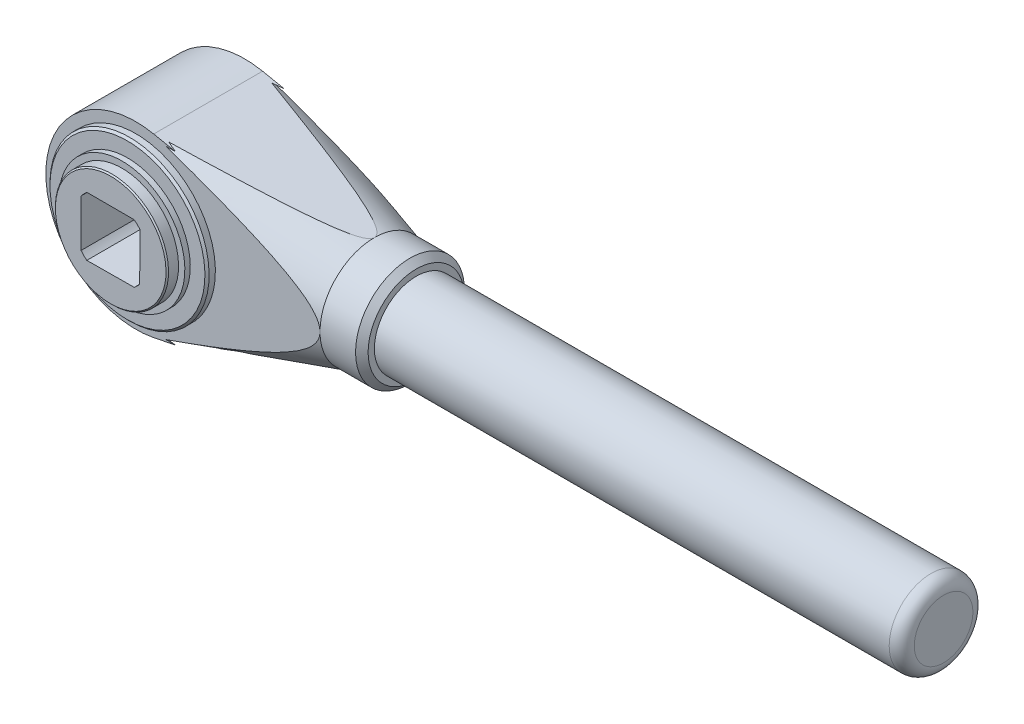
ISO-10303-21;
HEADER;
FILE_DESCRIPTION(('STEP AP214'),'2;1');
FILE_NAME('part.step','',(''),(''),'','','');
FILE_SCHEMA(('AUTOMOTIVE_DESIGN { 1 0 10303 214 1 1 1 1 }'));
ENDSEC;
DATA;
#1=APPLICATION_CONTEXT('core data for automotive mechanical design processes');
#2=APPLICATION_PROTOCOL_DEFINITION('international standard','automotive_design',2000,#1);
#3=PRODUCT_CONTEXT('',#1,'mechanical');
#4=PRODUCT('Part','Part','',(#3));
#5=PRODUCT_RELATED_PRODUCT_CATEGORY('part','',(#4));
#6=PRODUCT_DEFINITION_FORMATION('','',#4);
#7=PRODUCT_DEFINITION_CONTEXT('part definition',#1,'design');
#8=PRODUCT_DEFINITION('design','',#6,#7);
#9=PRODUCT_DEFINITION_SHAPE('','',#8);
#10=(LENGTH_UNIT() NAMED_UNIT(*) SI_UNIT(.MILLI.,.METRE.));
#11=(NAMED_UNIT(*) PLANE_ANGLE_UNIT() SI_UNIT($,.RADIAN.));
#12=(NAMED_UNIT(*) SI_UNIT($,.STERADIAN.) SOLID_ANGLE_UNIT());
#13=UNCERTAINTY_MEASURE_WITH_UNIT(LENGTH_MEASURE(1.E-05),#10,'distance_accuracy_value','');
#14=(GEOMETRIC_REPRESENTATION_CONTEXT(3) GLOBAL_UNCERTAINTY_ASSIGNED_CONTEXT((#13)) GLOBAL_UNIT_ASSIGNED_CONTEXT((#10,
#11,#12)) REPRESENTATION_CONTEXT('',''));
#15=CARTESIAN_POINT('',(0.,0.,0.));
#16=DIRECTION('',(0.,0.,1.));
#17=DIRECTION('',(1.,0.,0.));
#18=AXIS2_PLACEMENT_3D('',#15,#16,#17);
#19=CARTESIAN_POINT('',(44.,13.0000000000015,32.));
#20=DIRECTION('',(-0.19909686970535,-0.979979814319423,0.));
#21=DIRECTION('',(0.979979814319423,-0.19909686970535,0.));
#22=AXIS2_PLACEMENT_3D('',#19,#20,#21);
#23=PLANE('',#22);
#24=CARTESIAN_POINT('',(7.18839661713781,20.478802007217,31.2625257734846));
#25=CARTESIAN_POINT('',(7.98277463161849,20.3174127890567,31.0754689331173));
#26=CARTESIAN_POINT('',(8.77699762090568,20.1560550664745,30.8877255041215));
#27=CARTESIAN_POINT('',(10.3650810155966,19.833413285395,30.510627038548));
#28=CARTESIAN_POINT('',(11.1589414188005,19.6721292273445,30.3212719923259));
#29=CARTESIAN_POINT('',(13.542315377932,19.1879128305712,29.7498526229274));
#30=CARTESIAN_POINT('',(15.1311893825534,18.8651104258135,29.3650052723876));
#31=CARTESIAN_POINT('',(18.3624872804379,18.2086261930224,28.5714290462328));
#32=CARTESIAN_POINT('',(20.0048258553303,17.8749616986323,28.162336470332));
#33=CARTESIAN_POINT('',(22.4641938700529,17.3753060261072,27.5369423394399));
#34=CARTESIAN_POINT('',(23.2826964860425,17.2090155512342,27.3266763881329));
#35=CARTESIAN_POINT('',(24.918414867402,16.8766960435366,26.9011199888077));
#36=CARTESIAN_POINT('',(25.73563068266,16.7106670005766,26.6858297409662));
#37=CARTESIAN_POINT('',(27.2284931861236,16.4073707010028,26.2862996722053));
#38=CARTESIAN_POINT('',(27.9043971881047,16.2700511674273,26.1030624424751));
#39=CARTESIAN_POINT('',(29.2548459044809,15.9956882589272,25.7310742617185));
#40=CARTESIAN_POINT('',(29.9293904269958,15.8586449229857,25.5423225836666));
#41=CARTESIAN_POINT('',(31.279396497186,15.5843719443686,25.1570029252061));
#42=CARTESIAN_POINT('',(31.9548499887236,15.4471439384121,24.9604054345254));
#43=CARTESIAN_POINT('',(33.302781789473,15.1732923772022,24.5579689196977));
#44=CARTESIAN_POINT('',(33.9752613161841,15.0366685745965,24.3521341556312));
#45=CARTESIAN_POINT('',(35.303998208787,14.7667167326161,23.931608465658));
#46=CARTESIAN_POINT('',(35.9603257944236,14.633374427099,23.7171513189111));
#47=CARTESIAN_POINT('',(36.9409882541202,14.4341388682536,23.3818054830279));
#48=CARTESIAN_POINT('',(37.2675275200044,14.3677977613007,23.2676387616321));
#49=CARTESIAN_POINT('',(37.9186252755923,14.2355179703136,23.0336733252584));
#50=CARTESIAN_POINT('',(38.2431840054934,14.1695792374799,22.9138753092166));
#51=CARTESIAN_POINT('',(38.8873337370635,14.0387110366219,22.6680028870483));
#52=CARTESIAN_POINT('',(39.2069437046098,13.9737777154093,22.5419805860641));
#53=CARTESIAN_POINT('',(39.8426607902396,13.8446227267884,22.2805498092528));
#54=CARTESIAN_POINT('',(40.1587660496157,13.7804014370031,22.14513660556));
#55=CARTESIAN_POINT('',(40.7845943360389,13.6532554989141,21.8619290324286));
#56=CARTESIAN_POINT('',(41.0943336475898,13.5903275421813,21.7141729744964));
#57=CARTESIAN_POINT('',(41.5518546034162,13.4973756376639,21.478513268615));
#58=CARTESIAN_POINT('',(41.7031181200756,13.4666442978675,21.3976593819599));
#59=CARTESIAN_POINT('',(42.0024444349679,13.4058318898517,21.2300234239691));
#60=CARTESIAN_POINT('',(42.1505081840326,13.3757506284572,21.1432431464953));
#61=CARTESIAN_POINT('',(42.3365652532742,13.3379504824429,21.0276086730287));
#62=CARTESIAN_POINT('',(42.3766737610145,13.3298018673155,21.0022809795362));
#63=CARTESIAN_POINT('',(42.4564915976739,13.3135857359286,20.9509949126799));
#64=CARTESIAN_POINT('',(42.4962010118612,13.3055182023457,20.9250366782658));
#65=CARTESIAN_POINT('',(42.6146373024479,13.2814561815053,20.8461499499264));
#66=CARTESIAN_POINT('',(42.692699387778,13.2655967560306,20.7921926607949));
#67=CARTESIAN_POINT('',(42.9234289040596,13.2187207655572,20.6256564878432));
#68=CARTESIAN_POINT('',(43.0729083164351,13.1883518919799,20.5082508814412));
#69=CARTESIAN_POINT('',(43.3160772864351,13.1389486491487,20.2911361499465));
#70=CARTESIAN_POINT('',(43.4135487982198,13.1191459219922,20.195880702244));
#71=CARTESIAN_POINT('',(43.5954403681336,13.0821920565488,19.9931060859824));
#72=CARTESIAN_POINT('',(43.6798994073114,13.0650329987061,19.8856252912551));
#73=CARTESIAN_POINT('',(43.7957093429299,13.0415045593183,19.7039057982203));
#74=CARTESIAN_POINT('',(43.834470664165,13.0336296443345,19.6346535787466));
#75=CARTESIAN_POINT('',(43.9016325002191,13.0199847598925,19.4910308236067));
#76=CARTESIAN_POINT('',(43.9300425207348,13.0142128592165,19.4166650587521));
#77=CARTESIAN_POINT('',(43.9736662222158,13.0053500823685,19.2627651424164));
#78=CARTESIAN_POINT('',(43.9886966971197,13.0022964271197,19.1831747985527));
#79=CARTESIAN_POINT('',(44.0024666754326,12.9994988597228,19.022562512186));
#80=CARTESIAN_POINT('',(44.0012266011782,12.9997507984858,18.9415424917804));
#81=CARTESIAN_POINT('',(43.9842035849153,13.0032092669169,18.7940032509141));
#82=CARTESIAN_POINT('',(43.9707127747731,13.0059501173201,18.7271887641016));
#83=CARTESIAN_POINT('',(43.9338662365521,13.0134360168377,18.5964613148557));
#84=CARTESIAN_POINT('',(43.9105006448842,13.0181830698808,18.5325513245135));
#85=CARTESIAN_POINT('',(43.839696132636,13.0325680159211,18.3716929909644));
#86=CARTESIAN_POINT('',(43.7861922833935,13.0434380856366,18.2775565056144));
#87=CARTESIAN_POINT('',(43.6660810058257,13.0678404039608,18.0985033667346));
#88=CARTESIAN_POINT('',(43.5994355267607,13.0813803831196,18.0136146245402));
#89=CARTESIAN_POINT('',(43.4362349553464,13.1145369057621,17.8272049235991));
#90=CARTESIAN_POINT('',(43.3367294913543,13.134752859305,17.7284165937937));
#91=CARTESIAN_POINT('',(43.1289391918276,13.1769684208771,17.5408401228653));
#92=CARTESIAN_POINT('',(43.0206365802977,13.1989716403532,17.4520731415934));
#93=CARTESIAN_POINT('',(42.797676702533,13.2442691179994,17.2817375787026));
#94=CARTESIAN_POINT('',(42.6829824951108,13.2675708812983,17.2002198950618));
#95=CARTESIAN_POINT('',(42.4497963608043,13.3149459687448,17.0434051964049));
#96=CARTESIAN_POINT('',(42.3313084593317,13.3390184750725,16.9681018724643));
#97=CARTESIAN_POINT('',(41.9575243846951,13.4149580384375,16.7408093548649));
#98=CARTESIAN_POINT('',(41.6973574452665,13.4678146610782,16.5971944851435));
#99=CARTESIAN_POINT('',(41.1699367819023,13.5749676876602,16.3241003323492));
#100=CARTESIAN_POINT('',(40.9026775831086,13.6292652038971,16.194632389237));
#101=CARTESIAN_POINT('',(40.3630224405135,13.7389038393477,15.9456010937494));
#102=CARTESIAN_POINT('',(40.0906158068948,13.7942471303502,15.8260619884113));
#103=CARTESIAN_POINT('',(39.5426910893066,13.9055658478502,15.5946415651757));
#104=CARTESIAN_POINT('',(39.2671726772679,13.9615413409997,15.4827610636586));
#105=CARTESIAN_POINT('',(38.7129811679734,14.0741332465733,15.2646113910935));
#106=CARTESIAN_POINT('',(38.4343006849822,14.1307511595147,15.1583618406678));
#107=CARTESIAN_POINT('',(37.875209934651,14.2443384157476,14.9506597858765));
#108=CARTESIAN_POINT('',(37.5947995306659,14.3013077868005,14.8492076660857));
#109=CARTESIAN_POINT('',(37.033101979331,14.4154246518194,14.6503965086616));
#110=CARTESIAN_POINT('',(36.7518169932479,14.4725717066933,14.5530310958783));
#111=CARTESIAN_POINT('',(36.1881918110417,14.5870801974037,14.361576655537));
#112=CARTESIAN_POINT('',(35.9058516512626,14.6444416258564,14.267487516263));
#113=CARTESIAN_POINT('',(35.0281149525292,14.8227663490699,13.9796975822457));
#114=CARTESIAN_POINT('',(34.4312351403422,14.9440309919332,13.7907064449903));
#115=CARTESIAN_POINT('',(33.2348390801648,15.1870959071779,13.4215981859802));
#116=CARTESIAN_POINT('',(32.6353227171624,15.3088962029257,13.2414814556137));
#117=CARTESIAN_POINT('',(31.4342885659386,15.5529034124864,12.8880189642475));
#118=CARTESIAN_POINT('',(30.8327705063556,15.6751103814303,12.7146741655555));
#119=CARTESIAN_POINT('',(29.6282744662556,15.9198209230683,12.3733402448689));
#120=CARTESIAN_POINT('',(29.0252964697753,16.0423244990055,12.2053511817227));
#121=CARTESIAN_POINT('',(27.2130476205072,16.4105086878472,11.70735050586));
#122=CARTESIAN_POINT('',(26.0020795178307,16.6565341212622,11.3837746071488));
#123=CARTESIAN_POINT('',(23.577327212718,17.1491571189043,10.7483238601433));
#124=CARTESIAN_POINT('',(22.3635432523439,17.395754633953,10.4364480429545));
#125=CARTESIAN_POINT('',(19.9868385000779,17.8786160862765,9.83458147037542));
#126=CARTESIAN_POINT('',(18.8240054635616,18.1148621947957,9.54422920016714));
#127=CARTESIAN_POINT('',(16.4969103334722,18.5876447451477,8.96941940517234));
#128=CARTESIAN_POINT('',(15.3326482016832,18.8241811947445,8.68496204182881));
#129=CARTESIAN_POINT('',(13.0055091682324,19.2969726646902,8.12124385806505));
#130=CARTESIAN_POINT('',(11.8426345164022,19.5332272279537,7.84197335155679));
#131=CARTESIAN_POINT('',(9.51607812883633,20.0059003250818,7.28715356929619));
#132=CARTESIAN_POINT('',(8.35239642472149,20.2423188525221,7.01160415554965));
#133=CARTESIAN_POINT('',(7.18839661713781,20.478802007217,6.73747422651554));
#134=B_SPLINE_CURVE_WITH_KNOTS('',3,(#24,#25,#26,#27,#28,#29,#30,#31,#32,#33,#34,#35,#36,#37,
#38,#39,#40,#41,#42,#43,#44,#45,#46,#47,#48,#49,#50,#51,#52,#53,#54,#55,#56,#57,#58,#59,#60,#61,
#62,#63,#64,#65,#66,#67,#68,#69,#70,#71,#72,#73,#74,#75,#76,#77,#78,#79,#80,#81,#82,#83,#84,#85,
#86,#87,#88,#89,#90,#91,#92,#93,#94,#95,#96,#97,#98,#99,#100,#101,#102,#103,#104,#105,#106,#107,
#108,#109,#110,#111,#112,#113,#114,#115,#116,#117,#118,#119,#120,#121,#122,#123,#124,#125,#126,
#127,#128,#129,#130,#131,#132,#133),.UNSPECIFIED.,.F.,.F.,(4,2,2,2,2,2,2,2,2,2,2,2,2,2,2,2,2,2,
2,2,2,2,2,2,2,2,2,2,2,2,2,2,2,2,2,2,2,2,2,2,2,2,2,2,2,2,2,2,2,2,2,2,2,2,4),(0.,2.49572797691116,
4.99147089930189,9.99059728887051,15.1658296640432,17.7496714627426,20.3334104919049,
22.4743059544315,24.6154849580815,26.7656608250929,28.9148550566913,31.0243553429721,
32.0809946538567,33.1375031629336,34.1863118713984,35.2356524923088,36.2818491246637,
36.8045079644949,37.3270092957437,37.4713983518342,37.6157558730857,37.9043738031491,
38.4806552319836,38.8931550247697,39.3043940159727,39.5429952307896,39.7813767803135,
40.0229743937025,40.2642687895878,40.4680300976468,40.6719954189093,40.9965760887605,
41.3221107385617,41.7460823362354,42.1709330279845,42.5985634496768,43.0257542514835,
43.9304777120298,44.8359211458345,45.7435144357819,46.6512043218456,47.5618731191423,
48.4726147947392,49.381878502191,50.291111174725,52.2041667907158,54.117306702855,
56.0307174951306,57.9441493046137,61.7761605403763,65.6078537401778,69.2726221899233,
72.937490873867,76.5946378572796,80.2516488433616),.UNSPECIFIED.);
#135=CARTESIAN_POINT('',(44.,13.0000000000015,19.));
#136=VERTEX_POINT('',#135);
#137=CARTESIAN_POINT('',(7.18859661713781,20.478761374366,6.73752132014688));
#138=VERTEX_POINT('',#137);
#139=EDGE_CURVE('E299',#136,#138,#134,.T.);
#140=ORIENTED_EDGE('',*,*,#139,.T.);
#141=CARTESIAN_POINT('',(107.987633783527,1.49880108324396E-12,19.));
#142=DIRECTION('',(-0.19909686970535,-0.979979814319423,0.));
#143=DIRECTION('',(-0.979979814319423,0.19909686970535,0.));
#144=AXIS2_PLACEMENT_3D('',#141,#142,#143);
#145=ELLIPSE('',#144,119.888352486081,23.8693956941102);
#146=CARTESIAN_POINT('',(9.45311326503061,20.0186925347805,6.));
#147=VERTEX_POINT('',#146);
#148=EDGE_CURVE('E243',#138,#147,#145,.T.);
#149=ORIENTED_EDGE('',*,*,#148,.T.);
#150=DIRECTION('',(-0.979979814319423,0.19909686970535,0.));
#151=VECTOR('',#150,1.);
#152=CARTESIAN_POINT('',(44.,13.0000000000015,6.));
#153=LINE('',#152,#151);
#154=CARTESIAN_POINT('',(4.280582,21.0695660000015,6.));
#155=VERTEX_POINT('',#154);
#156=EDGE_CURVE('E380',#147,#155,#153,.T.);
#157=ORIENTED_EDGE('',*,*,#156,.T.);
#158=DIRECTION('',(0.,0.,-1.));
#159=VECTOR('',#158,1.);
#160=CARTESIAN_POINT('',(4.280582,21.0695660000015,32.));
#161=LINE('',#160,#159);
#162=CARTESIAN_POINT('',(4.280582,21.0695660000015,32.));
#163=VERTEX_POINT('',#162);
#164=EDGE_CURVE('E397',#163,#155,#161,.T.);
#165=ORIENTED_EDGE('',*,*,#164,.F.);
#166=DIRECTION('',(-0.979979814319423,0.19909686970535,0.));
#167=VECTOR('',#166,1.);
#168=CARTESIAN_POINT('',(44.,13.0000000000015,32.));
#169=LINE('',#168,#167);
#170=CARTESIAN_POINT('',(9.45311326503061,20.0186925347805,32.));
#171=VERTEX_POINT('',#170);
#172=EDGE_CURVE('E390',#171,#163,#169,.T.);
#173=ORIENTED_EDGE('',*,*,#172,.F.);
#174=CARTESIAN_POINT('',(7.18859661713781,20.478761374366,31.2624786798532));
#175=VERTEX_POINT('',#174);
#176=EDGE_CURVE('E249',#171,#175,#145,.T.);
#177=ORIENTED_EDGE('',*,*,#176,.T.);
#178=EDGE_CURVE('E307',#175,#136,#134,.T.);
#179=ORIENTED_EDGE('',*,*,#178,.T.);
#180=EDGE_LOOP('',(#140,#149,#157,#165,#173,#177,#179));
#181=FACE_BOUND('',#180,.T.);
#182=ADVANCED_FACE('F15',(#181),#23,.F.);
#183=CARTESIAN_POINT('',(0.,1.49880108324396E-12,32.));
#184=DIRECTION('',(0.,0.,-1.));
#185=DIRECTION('',(-1.,0.,0.));
#186=AXIS2_PLACEMENT_3D('',#183,#184,#185);
#187=CYLINDRICAL_SURFACE('',#186,21.4999998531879);
#188=DIRECTION('',(0.,0.,-1.));
#189=VECTOR('',#188,1.);
#190=CARTESIAN_POINT('',(4.280582,-21.0695659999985,32.));
#191=LINE('',#190,#189);
#192=CARTESIAN_POINT('',(4.280582,-21.0695659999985,32.));
#193=VERTEX_POINT('',#192);
#194=CARTESIAN_POINT('',(4.280582,-21.0695659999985,6.));
#195=VERTEX_POINT('',#194);
#196=EDGE_CURVE('E393',#193,#195,#191,.T.);
#197=ORIENTED_EDGE('',*,*,#196,.F.);
#198=CARTESIAN_POINT('',(0.,1.49880108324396E-12,32.));
#199=DIRECTION('',(0.,0.,1.));
#200=DIRECTION('',(1.,0.,0.));
#201=AXIS2_PLACEMENT_3D('',#198,#199,#200);
#202=CIRCLE('',#201,21.4999998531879);
#203=EDGE_CURVE('E386',#163,#193,#202,.T.);
#204=ORIENTED_EDGE('',*,*,#203,.F.);
#205=ORIENTED_EDGE('',*,*,#164,.T.);
#206=CARTESIAN_POINT('',(0.,1.49880108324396E-12,6.));
#207=DIRECTION('',(0.,0.,1.));
#208=DIRECTION('',(1.,0.,0.));
#209=AXIS2_PLACEMENT_3D('',#206,#207,#208);
#210=CIRCLE('',#209,21.4999998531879);
#211=EDGE_CURVE('E376',#155,#195,#210,.T.);
#212=ORIENTED_EDGE('',*,*,#211,.T.);
#213=EDGE_LOOP('',(#197,#204,#205,#212));
#214=FACE_BOUND('',#213,.T.);
#215=ADVANCED_FACE('F283',(#214),#187,.T.);
#216=CARTESIAN_POINT('',(44.,-12.9999999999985,32.));
#217=DIRECTION('',(0.19909686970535,-0.979979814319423,0.));
#218=DIRECTION('',(0.979979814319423,0.19909686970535,0.));
#219=AXIS2_PLACEMENT_3D('',#216,#217,#218);
#220=PLANE('',#219);
#221=CARTESIAN_POINT('',(107.987633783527,1.49880108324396E-12,19.));
#222=DIRECTION('',(0.19909686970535,-0.979979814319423,0.));
#223=DIRECTION('',(-0.979979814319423,-0.19909686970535,0.));
#224=AXIS2_PLACEMENT_3D('',#221,#222,#223);
#225=ELLIPSE('',#224,119.888352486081,23.8693956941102);
#226=CARTESIAN_POINT('',(7.18859661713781,-20.478761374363,6.73752132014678));
#227=VERTEX_POINT('',#226);
#228=CARTESIAN_POINT('',(9.4531132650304,-20.0186925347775,6.));
#229=VERTEX_POINT('',#228);
#230=EDGE_CURVE('E239',#227,#229,#225,.T.);
#231=ORIENTED_EDGE('',*,*,#230,.F.);
#232=CARTESIAN_POINT('',(7.18839661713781,-20.478802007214,31.2625257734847));
#233=CARTESIAN_POINT('',(7.98277463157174,-20.3174127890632,31.0754689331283));
#234=CARTESIAN_POINT('',(8.77699762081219,-20.1560550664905,30.8877255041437));
#235=CARTESIAN_POINT('',(10.3650810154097,-19.8334132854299,30.5106270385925));
#236=CARTESIAN_POINT('',(11.1589414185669,-19.672129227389,30.3212719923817));
#237=CARTESIAN_POINT('',(13.5423153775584,-19.1879128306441,29.7498526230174));
#238=CARTESIAN_POINT('',(15.1311893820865,-18.8651104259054,29.3650052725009));
#239=CARTESIAN_POINT('',(18.3624872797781,-18.2086261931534,28.5714290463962));
#240=CARTESIAN_POINT('',(20.0048258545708,-17.8749616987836,28.1623364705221));
#241=CARTESIAN_POINT('',(22.4641938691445,-17.3753060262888,27.5369423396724));
#242=CARTESIAN_POINT('',(23.2826964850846,-17.2090155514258,27.3266763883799));
#243=CARTESIAN_POINT('',(24.9184148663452,-16.8766960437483,26.9011199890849));
#244=CARTESIAN_POINT('',(25.735630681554,-16.7106670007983,26.685829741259));
#245=CARTESIAN_POINT('',(27.2284931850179,-16.4073707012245,26.2862996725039));
#246=CARTESIAN_POINT('',(27.9043971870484,-16.2700511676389,26.1030624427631));
#247=CARTESIAN_POINT('',(29.2548459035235,-15.9956882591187,25.7310742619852));
#248=CARTESIAN_POINT('',(29.9293904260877,-15.8586449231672,25.5423225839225));
#249=CARTESIAN_POINT('',(31.2793964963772,-15.5843719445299,25.1570029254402));
#250=CARTESIAN_POINT('',(31.9548499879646,-15.4471439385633,24.9604054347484));
#251=CARTESIAN_POINT('',(33.3027817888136,-15.1732923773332,24.5579689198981));
#252=CARTESIAN_POINT('',(33.9752613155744,-15.0366685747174,24.3521341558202));
#253=CARTESIAN_POINT('',(35.303998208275,-14.7667167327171,23.9316084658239));
#254=CARTESIAN_POINT('',(35.9603257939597,-14.6333744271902,23.7171513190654));
#255=CARTESIAN_POINT('',(36.9409882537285,-14.4341388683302,23.381805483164));
#256=CARTESIAN_POINT('',(37.2675275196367,-14.3677977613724,23.267638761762));
#257=CARTESIAN_POINT('',(37.9186252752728,-14.2355179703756,23.0336733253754));
#258=CARTESIAN_POINT('',(38.2431840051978,-14.169579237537,22.9138753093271));
#259=CARTESIAN_POINT('',(38.8873337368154,-14.0387110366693,22.6680028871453));
#260=CARTESIAN_POINT('',(39.2069437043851,-13.9737777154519,22.5419805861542));
#261=CARTESIAN_POINT('',(39.8426607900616,-13.8446227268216,22.2805498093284));
#262=CARTESIAN_POINT('',(40.1587660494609,-13.7804014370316,22.1451366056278));
#263=CARTESIAN_POINT('',(40.78459433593,-13.6532554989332,21.8619290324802));
#264=CARTESIAN_POINT('',(41.0943336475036,-13.5903275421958,21.7141729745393));
#265=CARTESIAN_POINT('',(41.5518546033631,-13.4973756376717,21.4785132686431));
#266=CARTESIAN_POINT('',(41.7031181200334,-13.4666442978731,21.3976593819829));
#267=CARTESIAN_POINT('',(42.0024444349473,-13.4058318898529,21.2300234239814));
#268=CARTESIAN_POINT('',(42.1505081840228,-13.3757506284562,21.1432431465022));
#269=CARTESIAN_POINT('',(42.3365652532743,-13.3379504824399,21.0276086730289));
#270=CARTESIAN_POINT('',(42.3766737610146,-13.3298018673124,21.0022809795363));
#271=CARTESIAN_POINT('',(42.456491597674,-13.3135857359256,20.9509949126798));
#272=CARTESIAN_POINT('',(42.4962010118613,-13.3055182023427,20.9250366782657));
#273=CARTESIAN_POINT('',(42.6146373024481,-13.2814561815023,20.8461499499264));
#274=CARTESIAN_POINT('',(42.6926993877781,-13.2655967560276,20.7921926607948));
#275=CARTESIAN_POINT('',(42.9234289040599,-13.2187207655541,20.625656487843));
#276=CARTESIAN_POINT('',(43.0729083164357,-13.1883518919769,20.5082508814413));
#277=CARTESIAN_POINT('',(43.3160772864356,-13.1389486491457,20.2911361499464));
#278=CARTESIAN_POINT('',(43.4135487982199,-13.1191459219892,20.1958807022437));
#279=CARTESIAN_POINT('',(43.5954403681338,-13.0821920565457,19.9931060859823));
#280=CARTESIAN_POINT('',(43.6798994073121,-13.065032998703,19.8856252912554));
#281=CARTESIAN_POINT('',(43.7957093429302,-13.0415045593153,19.7039057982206));
#282=CARTESIAN_POINT('',(43.834470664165,-13.0336296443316,19.6346535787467));
#283=CARTESIAN_POINT('',(43.9016325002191,-13.0199847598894,19.4910308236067));
#284=CARTESIAN_POINT('',(43.9300425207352,-13.014212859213,19.4166650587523));
#285=CARTESIAN_POINT('',(43.9736662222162,-13.005350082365,19.2627651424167));
#286=CARTESIAN_POINT('',(43.9886966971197,-13.0022964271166,19.1831747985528));
#287=CARTESIAN_POINT('',(44.0024666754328,-12.9994988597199,19.022562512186));
#288=CARTESIAN_POINT('',(44.0012266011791,-12.9997507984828,18.9415424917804));
#289=CARTESIAN_POINT('',(43.9842035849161,-13.0032092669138,18.7940032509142));
#290=CARTESIAN_POINT('',(43.9707127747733,-13.0059501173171,18.7271887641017));
#291=CARTESIAN_POINT('',(43.9338662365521,-13.0134360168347,18.5964613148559));
#292=CARTESIAN_POINT('',(43.9105006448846,-13.0181830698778,18.5325513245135));
#293=CARTESIAN_POINT('',(43.8396961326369,-13.0325680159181,18.3716929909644));
#294=CARTESIAN_POINT('',(43.7861922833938,-13.0434380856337,18.2775565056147));
#295=CARTESIAN_POINT('',(43.6660810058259,-13.0678404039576,18.0985033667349));
#296=CARTESIAN_POINT('',(43.5994355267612,-13.0813803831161,18.0136146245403));
#297=CARTESIAN_POINT('',(43.4362349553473,-13.1145369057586,17.8272049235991));
#298=CARTESIAN_POINT('',(43.3367294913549,-13.1347528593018,17.728416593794));
#299=CARTESIAN_POINT('',(43.128939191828,-13.1769684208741,17.5408401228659));
#300=CARTESIAN_POINT('',(43.0206365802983,-13.19897164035,17.4520731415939));
#301=CARTESIAN_POINT('',(42.7976767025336,-13.2442691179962,17.281737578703));
#302=CARTESIAN_POINT('',(42.6829824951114,-13.2675708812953,17.2002198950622));
#303=CARTESIAN_POINT('',(42.449796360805,-13.3149459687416,17.0434051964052));
#304=CARTESIAN_POINT('',(42.3313084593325,-13.3390184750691,16.9681018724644));
#305=CARTESIAN_POINT('',(41.9575243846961,-13.4149580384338,16.7408093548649));
#306=CARTESIAN_POINT('',(41.6973574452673,-13.4678146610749,16.5971944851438));
#307=CARTESIAN_POINT('',(41.1699367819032,-13.5749676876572,16.3241003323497));
#308=CARTESIAN_POINT('',(40.9026775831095,-13.6292652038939,16.1946323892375));
#309=CARTESIAN_POINT('',(40.3630224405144,-13.7389038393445,15.9456010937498));
#310=CARTESIAN_POINT('',(40.0906158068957,-13.794247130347,15.8260619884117));
#311=CARTESIAN_POINT('',(39.5426910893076,-13.905565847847,15.594641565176));
#312=CARTESIAN_POINT('',(39.2671726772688,-13.9615413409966,15.482761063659));
#313=CARTESIAN_POINT('',(38.7129811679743,-14.0741332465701,15.2646113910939));
#314=CARTESIAN_POINT('',(38.4343006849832,-14.1307511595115,15.1583618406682));
#315=CARTESIAN_POINT('',(37.8752099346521,-14.2443384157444,14.9506597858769));
#316=CARTESIAN_POINT('',(37.594799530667,-14.3013077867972,14.849207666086));
#317=CARTESIAN_POINT('',(37.0331019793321,-14.4154246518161,14.650396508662));
#318=CARTESIAN_POINT('',(36.7518169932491,-14.4725717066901,14.5530310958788));
#319=CARTESIAN_POINT('',(36.188191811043,-14.5870801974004,14.3615766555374));
#320=CARTESIAN_POINT('',(35.9058516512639,-14.6444416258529,14.2674875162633));
#321=CARTESIAN_POINT('',(35.0281149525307,-14.8227663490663,13.979697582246));
#322=CARTESIAN_POINT('',(34.4312351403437,-14.9440309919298,13.7907064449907));
#323=CARTESIAN_POINT('',(33.2348390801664,-15.1870959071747,13.4215981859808));
#324=CARTESIAN_POINT('',(32.6353227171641,-15.3088962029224,13.2414814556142));
#325=CARTESIAN_POINT('',(31.4342885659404,-15.552903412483,12.888018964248));
#326=CARTESIAN_POINT('',(30.8327705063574,-15.6751103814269,12.714674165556));
#327=CARTESIAN_POINT('',(29.6282744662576,-15.9198209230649,12.3733402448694));
#328=CARTESIAN_POINT('',(29.0252964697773,-16.0423244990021,12.2053511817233));
#329=CARTESIAN_POINT('',(27.2130476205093,-16.4105086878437,11.7073505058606));
#330=CARTESIAN_POINT('',(26.0020795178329,-16.6565341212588,11.3837746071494));
#331=CARTESIAN_POINT('',(23.5773272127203,-17.1491571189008,10.7483238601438));
#332=CARTESIAN_POINT('',(22.3635432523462,-17.3957546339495,10.4364480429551));
#333=CARTESIAN_POINT('',(19.9868385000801,-17.878616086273,9.83458147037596));
#334=CARTESIAN_POINT('',(18.8240054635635,-18.1148621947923,9.54422920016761));
#335=CARTESIAN_POINT('',(16.4969103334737,-18.5876447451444,8.9694194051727));
#336=CARTESIAN_POINT('',(15.3326482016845,-18.8241811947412,8.6849620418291));
#337=CARTESIAN_POINT('',(13.0055091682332,-19.296972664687,8.12124385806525));
#338=CARTESIAN_POINT('',(11.8426345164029,-19.5332272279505,7.84197335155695));
#339=CARTESIAN_POINT('',(9.51607812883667,-20.0059003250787,7.28715356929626));
#340=CARTESIAN_POINT('',(8.35239642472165,-20.2423188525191,7.01160415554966));
#341=CARTESIAN_POINT('',(7.18839661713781,-20.478802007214,6.73747422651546));
#342=B_SPLINE_CURVE_WITH_KNOTS('',3,(#232,#233,#234,#235,#236,#237,#238,#239,#240,#241,#242,
#243,#244,#245,#246,#247,#248,#249,#250,#251,#252,#253,#254,#255,#256,#257,#258,#259,#260,#261,
#262,#263,#264,#265,#266,#267,#268,#269,#270,#271,#272,#273,#274,#275,#276,#277,#278,#279,#280,
#281,#282,#283,#284,#285,#286,#287,#288,#289,#290,#291,#292,#293,#294,#295,#296,#297,#298,#299,
#300,#301,#302,#303,#304,#305,#306,#307,#308,#309,#310,#311,#312,#313,#314,#315,#316,#317,#318,
#319,#320,#321,#322,#323,#324,#325,#326,#327,#328,#329,#330,#331,#332,#333,#334,#335,#336,#337,
#338,#339,#340,#341),.UNSPECIFIED.,.F.,.F.,(4,2,2,2,2,2,2,2,2,2,2,2,2,2,2,2,2,2,2,2,2,2,2,2,2,2,
2,2,2,2,2,2,2,2,2,2,2,2,2,2,2,2,2,2,2,2,2,2,2,2,2,2,2,2,4),(0.,2.49572797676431,
4.99147089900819,9.99059728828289,15.1658296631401,17.7496714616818,20.3334104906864,
22.4743059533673,24.6154849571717,26.765660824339,28.914855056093,31.0243553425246,
32.0809946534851,33.1375031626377,34.1863118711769,35.2356524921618,36.2818491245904,
36.8045079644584,37.3270092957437,37.4713983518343,37.6157558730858,37.9043738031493,
38.4806552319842,38.8931550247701,39.3043940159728,39.5429952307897,39.7813767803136,
40.0229743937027,40.264268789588,40.468030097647,40.6719954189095,40.9965760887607,
41.3221107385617,41.7460823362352,42.1709330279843,42.5985634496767,43.0257542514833,
43.9304777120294,44.835921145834,45.7435144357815,46.6512043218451,47.5618731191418,
48.4726147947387,49.3818785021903,50.2911111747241,52.2041667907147,54.1173067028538,
56.0307174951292,57.9441493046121,61.7761605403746,65.6078537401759,69.2726221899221,
72.9374908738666,76.5946378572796,80.2516488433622),.UNSPECIFIED.);
#343=CARTESIAN_POINT('',(44.,-12.9999999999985,19.));
#344=VERTEX_POINT('',#343);
#345=EDGE_CURVE('E265',#344,#227,#342,.T.);
#346=ORIENTED_EDGE('',*,*,#345,.F.);
#347=CARTESIAN_POINT('',(7.18859661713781,-20.478761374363,31.2624786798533));
#348=VERTEX_POINT('',#347);
#349=EDGE_CURVE('E308',#348,#344,#342,.T.);
#350=ORIENTED_EDGE('',*,*,#349,.F.);
#351=CARTESIAN_POINT('',(9.4531132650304,-20.0186925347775,32.));
#352=VERTEX_POINT('',#351);
#353=EDGE_CURVE('E244',#352,#348,#225,.T.);
#354=ORIENTED_EDGE('',*,*,#353,.F.);
#355=DIRECTION('',(-0.979979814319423,-0.19909686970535,0.));
#356=VECTOR('',#355,1.);
#357=CARTESIAN_POINT('',(44.,-12.9999999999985,32.));
#358=LINE('',#357,#356);
#359=EDGE_CURVE('E383',#352,#193,#358,.T.);
#360=ORIENTED_EDGE('',*,*,#359,.T.);
#361=ORIENTED_EDGE('',*,*,#196,.T.);
#362=DIRECTION('',(-0.979979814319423,-0.19909686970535,0.));
#363=VECTOR('',#362,1.);
#364=CARTESIAN_POINT('',(44.,-12.9999999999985,6.));
#365=LINE('',#364,#363);
#366=EDGE_CURVE('E373',#229,#195,#365,.T.);
#367=ORIENTED_EDGE('',*,*,#366,.F.);
#368=EDGE_LOOP('',(#231,#346,#350,#354,#360,#361,#367));
#369=FACE_BOUND('',#368,.T.);
#370=ADVANCED_FACE('F281',(#369),#220,.T.);
#371=CARTESIAN_POINT('',(0.,1.49880108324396E-12,32.));
#372=DIRECTION('',(0.,0.,1.));
#373=DIRECTION('',(1.,0.,0.));
#374=AXIS2_PLACEMENT_3D('',#371,#372,#373);
#375=PLANE('',#374);
#376=DIRECTION('',(-1.,0.,0.));
#377=VECTOR('',#376,1.);
#378=CARTESIAN_POINT('',(20.1807993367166,20.0186925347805,32.));
#379=LINE('',#378,#377);
#380=CARTESIAN_POINT('',(7.18859661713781,20.0186925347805,32.));
#381=VERTEX_POINT('',#380);
#382=EDGE_CURVE('E252',#171,#381,#379,.T.);
#383=ORIENTED_EDGE('',*,*,#382,.F.);
#384=ORIENTED_EDGE('',*,*,#172,.T.);
#385=ORIENTED_EDGE('',*,*,#203,.T.);
#386=ORIENTED_EDGE('',*,*,#359,.F.);
#387=DIRECTION('',(-1.,0.,0.));
#388=VECTOR('',#387,1.);
#389=CARTESIAN_POINT('',(20.1807993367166,-20.0186925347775,32.));
#390=LINE('',#389,#388);
#391=CARTESIAN_POINT('',(7.18859661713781,-20.0186925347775,32.));
#392=VERTEX_POINT('',#391);
#393=EDGE_CURVE('E248',#392,#352,#390,.F.);
#394=ORIENTED_EDGE('',*,*,#393,.F.);
#395=CARTESIAN_POINT('',(-20.3730004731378,-29.2486758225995,32.));
#396=CARTESIAN_POINT('',(-18.9796117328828,-28.7984179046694,32.));
#397=CARTESIAN_POINT('',(-17.5867119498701,-28.3466417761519,32.));
#398=CARTESIAN_POINT('',(-14.8020716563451,-27.4395091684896,32.));
#399=CARTESIAN_POINT('',(-13.4103311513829,-26.9841526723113,32.));
#400=CARTESIAN_POINT('',(-10.6278421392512,-26.0692006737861,32.));
#401=CARTESIAN_POINT('',(-9.23709398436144,-25.6096040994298,32.));
#402=CARTESIAN_POINT('',(-6.45720185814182,-24.6855893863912,32.));
#403=CARTESIAN_POINT('',(-5.06805788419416,-24.2211712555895,32.));
#404=CARTESIAN_POINT('',(-2.32317751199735,-23.297246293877,32.));
#405=CARTESIAN_POINT('',(-0.967398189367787,-22.8378670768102,32.));
#406=CARTESIAN_POINT('',(1.74195384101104,-21.9126484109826,32.));
#407=CARTESIAN_POINT('',(3.0955265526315,-21.4468089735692,32.));
#408=CARTESIAN_POINT('',(5.79972923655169,-20.5074345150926,32.));
#409=CARTESIAN_POINT('',(7.15035969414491,-20.0339008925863,32.));
#410=CARTESIAN_POINT('',(9.84824833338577,-19.0773334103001,32.));
#411=CARTESIAN_POINT('',(11.1955065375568,-18.5942996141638,32.));
#412=CARTESIAN_POINT('',(13.8043146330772,-17.6459879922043,32.));
#413=CARTESIAN_POINT('',(15.0661167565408,-17.1814049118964,32.));
#414=CARTESIAN_POINT('',(17.5852764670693,-16.2389941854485,32.));
#415=CARTESIAN_POINT('',(18.8426323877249,-15.7611620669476,32.));
#416=CARTESIAN_POINT('',(20.7324913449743,-15.0283877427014,32.));
#417=CARTESIAN_POINT('',(21.3674234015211,-14.7797072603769,32.));
#418=CARTESIAN_POINT('',(22.6353057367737,-14.2773486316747,32.));
#419=CARTESIAN_POINT('',(23.2682560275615,-14.0236705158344,32.));
#420=CARTESIAN_POINT('',(24.5311274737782,-13.5108040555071,32.));
#421=CARTESIAN_POINT('',(25.1610511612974,-13.2516219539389,32.));
#422=CARTESIAN_POINT('',(26.4180650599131,-12.7265003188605,32.));
#423=CARTESIAN_POINT('',(27.0451553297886,-12.4605609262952,32.));
#424=CARTESIAN_POINT('',(28.3032562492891,-11.9174866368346,32.));
#425=CARTESIAN_POINT('',(28.9342259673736,-11.6402567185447,32.));
#426=CARTESIAN_POINT('',(30.1917998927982,-11.0758903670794,32.));
#427=CARTESIAN_POINT('',(30.8184037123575,-10.7887530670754,32.));
#428=CARTESIAN_POINT('',(32.0686062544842,-10.2011009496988,32.));
#429=CARTESIAN_POINT('',(32.6921805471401,-9.90053401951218,32.));
#430=CARTESIAN_POINT('',(33.9315984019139,-9.2841760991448,32.));
#431=CARTESIAN_POINT('',(34.5474441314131,-8.96838950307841,32.));
#432=CARTESIAN_POINT('',(35.457871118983,-8.48280846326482,32.));
#433=CARTESIAN_POINT('',(35.7564496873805,-8.3205024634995,32.));
#434=CARTESIAN_POINT('',(36.3505556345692,-7.99040781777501,32.));
#435=CARTESIAN_POINT('',(36.6460831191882,-7.82261936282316,32.));
#436=CARTESIAN_POINT('',(37.2338300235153,-7.48048711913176,32.));
#437=CARTESIAN_POINT('',(37.5260447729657,-7.3061352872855,32.));
#438=CARTESIAN_POINT('',(38.1059126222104,-6.95001170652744,32.));
#439=CARTESIAN_POINT('',(38.393565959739,-6.76824034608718,32.));
#440=CARTESIAN_POINT('',(38.9610171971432,-6.39731618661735,32.));
#441=CARTESIAN_POINT('',(39.2408578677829,-6.20822907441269,32.));
#442=CARTESIAN_POINT('',(39.7933805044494,-5.81966602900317,32.));
#443=CARTESIAN_POINT('',(40.0660607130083,-5.6201875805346,32.));
#444=CARTESIAN_POINT('',(40.6012424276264,-5.20918581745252,32.));
#445=CARTESIAN_POINT('',(40.8637658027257,-4.99769111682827,32.));
#446=CARTESIAN_POINT('',(41.3757539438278,-4.55953116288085,32.));
#447=CARTESIAN_POINT('',(41.625227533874,-4.3328764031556,32.));
#448=CARTESIAN_POINT('',(41.9334778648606,-4.03003984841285,32.));
#449=CARTESIAN_POINT('',(42.0007566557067,-3.96246453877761,32.));
#450=CARTESIAN_POINT('',(42.1336656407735,-3.82570159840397,32.));
#451=CARTESIAN_POINT('',(42.1992957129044,-3.75651384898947,32.));
#452=CARTESIAN_POINT('',(42.3934945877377,-3.54633433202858,32.));
#453=CARTESIAN_POINT('',(42.519319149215,-3.4027778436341,32.));
#454=CARTESIAN_POINT('',(42.7615793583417,-3.10830184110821,32.));
#455=CARTESIAN_POINT('',(42.8780305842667,-2.95739524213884,32.));
#456=CARTESIAN_POINT('',(43.0993010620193,-2.6473428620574,32.));
#457=CARTESIAN_POINT('',(43.2041254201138,-2.48820074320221,32.));
#458=CARTESIAN_POINT('',(43.4344712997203,-2.1018118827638,32.));
#459=CARTESIAN_POINT('',(43.5537699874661,-1.87074763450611,32.));
#460=CARTESIAN_POINT('',(43.7552621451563,-1.39281871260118,32.));
#461=CARTESIAN_POINT('',(43.8375059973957,-1.14597601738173,32.));
#462=CARTESIAN_POINT('',(43.9461142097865,-0.678250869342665,32.));
#463=CARTESIAN_POINT('',(43.9789216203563,-0.458895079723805,32.));
#464=CARTESIAN_POINT('',(44.0062752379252,-0.017874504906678,32.));
#465=CARTESIAN_POINT('',(44.0008490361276,0.203788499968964,32.));
#466=CARTESIAN_POINT('',(43.9525376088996,0.642319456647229,32.));
#467=CARTESIAN_POINT('',(43.9097431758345,0.859197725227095,32.));
#468=CARTESIAN_POINT('',(43.7916436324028,1.2838684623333,32.));
#469=CARTESIAN_POINT('',(43.7163011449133,1.49165018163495,32.));
#470=CARTESIAN_POINT('',(43.4854211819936,2.01942342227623,32.));
#471=CARTESIAN_POINT('',(43.309025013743,2.33024548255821,32.));
#472=CARTESIAN_POINT('',(43.0116968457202,2.77372746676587,32.));
#473=CARTESIAN_POINT('',(42.9069040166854,2.91801240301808,32.));
#474=CARTESIAN_POINT('',(42.6883987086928,3.19969068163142,32.));
#475=CARTESIAN_POINT('',(42.5746881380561,3.33708548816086,32.));
#476=CARTESIAN_POINT('',(42.2975916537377,3.65424485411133,32.));
#477=CARTESIAN_POINT('',(42.1311419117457,3.83131180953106,32.));
#478=CARTESIAN_POINT('',(41.7881337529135,4.17543438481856,32.));
#479=CARTESIAN_POINT('',(41.6115707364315,4.34248537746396,32.));
#480=CARTESIAN_POINT('',(41.2503639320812,4.66819798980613,32.));
#481=CARTESIAN_POINT('',(41.0657068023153,4.82684472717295,32.));
#482=CARTESIAN_POINT('',(40.6902258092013,5.13667435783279,32.));
#483=CARTESIAN_POINT('',(40.4994011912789,5.28785633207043,32.));
#484=CARTESIAN_POINT('',(40.1115362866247,5.58472955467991,32.));
#485=CARTESIAN_POINT('',(39.914463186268,5.73037777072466,32.));
#486=CARTESIAN_POINT('',(39.5162345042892,6.01597679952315,32.));
#487=CARTESIAN_POINT('',(39.3150787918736,6.15592742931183,32.));
#488=CARTESIAN_POINT('',(38.9096309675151,6.43067792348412,32.));
#489=CARTESIAN_POINT('',(38.7053427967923,6.56548361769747,32.));
#490=CARTESIAN_POINT('',(38.2939482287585,6.8306954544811,32.));
#491=CARTESIAN_POINT('',(38.0868419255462,6.96110174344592,32.));
#492=CARTESIAN_POINT('',(37.4189190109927,7.37304162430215,32.));
#493=CARTESIAN_POINT('',(36.9534752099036,7.64708433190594,32.));
#494=CARTESIAN_POINT('',(36.0141914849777,8.18043894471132,32.));
#495=CARTESIAN_POINT('',(35.5403500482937,8.43974815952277,32.));
#496=CARTESIAN_POINT('',(34.5861019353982,8.94663237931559,32.));
#497=CARTESIAN_POINT('',(34.1056916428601,9.19420055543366,32.));
#498=CARTESIAN_POINT('',(33.1399719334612,9.67959821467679,32.));
#499=CARTESIAN_POINT('',(32.654662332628,9.917427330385,32.));
#500=CARTESIAN_POINT('',(31.6789920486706,10.3855172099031,32.));
#501=CARTESIAN_POINT('',(31.1886220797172,10.6157585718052,32.));
#502=CARTESIAN_POINT('',(30.2047007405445,11.0693438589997,32.));
#503=CARTESIAN_POINT('',(29.7111493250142,11.2926876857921,32.));
#504=CARTESIAN_POINT('',(28.7215946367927,11.7333964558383,32.));
#505=CARTESIAN_POINT('',(28.225592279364,11.9507634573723,32.));
#506=CARTESIAN_POINT('',(27.2313816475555,12.3803943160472,32.));
#507=CARTESIAN_POINT('',(26.7331733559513,12.5926581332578,32.));
#508=CARTESIAN_POINT('',(25.2346454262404,13.2232676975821,32.));
#509=CARTESIAN_POINT('',(24.2315187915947,13.6349472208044,32.));
#510=CARTESIAN_POINT('',(22.2196578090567,14.4445309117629,32.));
#511=CARTESIAN_POINT('',(21.2109230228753,14.8424339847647,32.));
#512=CARTESIAN_POINT('',(19.1906828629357,15.6266122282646,32.));
#513=CARTESIAN_POINT('',(18.1791838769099,16.0129038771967,32.));
#514=CARTESIAN_POINT('',(16.6594200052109,16.5855972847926,32.));
#515=CARTESIAN_POINT('',(16.1524201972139,16.7753683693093,32.));
#516=CARTESIAN_POINT('',(15.1376586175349,17.1528626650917,32.));
#517=CARTESIAN_POINT('',(14.6298968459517,17.3405858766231,32.));
#518=CARTESIAN_POINT('',(13.0762996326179,17.9117298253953,32.));
#519=CARTESIAN_POINT('',(12.0293573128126,18.2921412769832,32.));
#520=CARTESIAN_POINT('',(9.93310267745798,19.0463833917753,32.));
#521=CARTESIAN_POINT('',(8.88379034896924,19.4202140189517,32.));
#522=CARTESIAN_POINT('',(6.7831776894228,20.1623077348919,32.));
#523=CARTESIAN_POINT('',(5.73187732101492,20.530570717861,32.));
#524=CARTESIAN_POINT('',(3.62761520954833,21.2623216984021,32.));
#525=CARTESIAN_POINT('',(2.57465346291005,21.6258096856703,32.));
#526=CARTESIAN_POINT('',(-0.586510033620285,22.710174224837,32.));
#527=CARTESIAN_POINT('',(-2.69682443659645,23.4248931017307,32.));
#528=CARTESIAN_POINT('',(-6.92164564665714,24.8418303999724,32.));
#529=CARTESIAN_POINT('',(-9.03615247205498,25.5440487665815,32.));
#530=CARTESIAN_POINT('',(-12.2113900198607,26.5903451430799,32.));
#531=CARTESIAN_POINT('',(-13.270908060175,26.9381093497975,32.));
#532=CARTESIAN_POINT('',(-15.3906636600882,27.6314285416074,32.));
#533=CARTESIAN_POINT('',(-16.4509012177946,27.9769835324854,32.));
#534=CARTESIAN_POINT('',(-19.632581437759,29.0106926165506,32.));
#535=CARTESIAN_POINT('',(-21.7549853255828,29.6958887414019,32.));
#536=CARTESIAN_POINT('',(-26.0017452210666,31.0598336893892,32.));
#537=CARTESIAN_POINT('',(-28.1261011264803,31.7385828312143,32.));
#538=CARTESIAN_POINT('',(-32.3765003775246,33.090778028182,32.));
#539=CARTESIAN_POINT('',(-34.5025437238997,33.7642240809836,32.));
#540=CARTESIAN_POINT('',(-38.6880485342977,35.085223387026,32.));
#541=CARTESIAN_POINT('',(-40.7474659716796,35.7329162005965,32.));
#542=CARTESIAN_POINT('',(-44.8674113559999,37.0247609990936,32.));
#543=CARTESIAN_POINT('',(-46.9279393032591,37.6689129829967,32.));
#544=CARTESIAN_POINT('',(-53.1109990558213,39.596854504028,32.));
#545=CARTESIAN_POINT('',(-57.234944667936,40.8761100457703,32.));
#546=CARTESIAN_POINT('',(-65.4799812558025,43.4237897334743,32.));
#547=CARTESIAN_POINT('',(-69.6010683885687,44.6922263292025,32.));
#548=CARTESIAN_POINT('',(-75.7842775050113,46.5895926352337,32.));
#549=CARTESIAN_POINT('',(-77.8455904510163,47.2211605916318,32.));
#550=CARTESIAN_POINT('',(-81.9686962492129,48.4827261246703,32.));
#551=CARTESIAN_POINT('',(-84.0304891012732,49.1127237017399,32.));
#552=CARTESIAN_POINT('',(-86.0924927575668,49.7420304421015,32.));
#553=B_SPLINE_CURVE_WITH_KNOTS('',3,(#395,#396,#397,#398,#399,#400,#401,#402,#403,#404,#405,
#406,#407,#408,#409,#410,#411,#412,#413,#414,#415,#416,#417,#418,#419,#420,#421,#422,#423,#424,
#425,#426,#427,#428,#429,#430,#431,#432,#433,#434,#435,#436,#437,#438,#439,#440,#441,#442,#443,
#444,#445,#446,#447,#448,#449,#450,#451,#452,#453,#454,#455,#456,#457,#458,#459,#460,#461,#462,
#463,#464,#465,#466,#467,#468,#469,#470,#471,#472,#473,#474,#475,#476,#477,#478,#479,#480,#481,
#482,#483,#484,#485,#486,#487,#488,#489,#490,#491,#492,#493,#494,#495,#496,#497,#498,#499,#500,
#501,#502,#503,#504,#505,#506,#507,#508,#509,#510,#511,#512,#513,#514,#515,#516,#517,#518,#519,
#520,#521,#522,#523,#524,#525,#526,#527,#528,#529,#530,#531,#532,#533,#534,#535,#536,#537,#538,
#539,#540,#541,#542,#543,#544,#545,#546,#547,#548,#549,#550,#551,#552),.UNSPECIFIED.,.F.,.F.,(4,
2,2,2,2,2,2,2,2,2,2,2,2,2,2,2,2,2,2,2,2,2,2,2,2,2,2,2,2,2,2,2,2,2,2,2,2,2,2,2,2,2,2,2,2,2,2,2,2,
2,2,2,2,2,2,2,2,2,2,2,2,2,2,2,2,2,2,2,2,2,2,2,2,2,2,2,2,2,4),(0.,4.39299352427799,
8.78600796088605,13.1801652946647,17.5743154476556,21.868775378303,26.1632277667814,
30.4569081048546,34.7505596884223,38.7843443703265,42.8195076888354,44.8651756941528,
46.9108312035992,48.9542787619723,50.9976837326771,53.0651775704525,55.1328527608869,
57.2093997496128,59.285350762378,60.3048303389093,61.3242744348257,62.3450113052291,
63.3656948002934,64.3787129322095,65.3919774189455,66.4029226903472,67.4131752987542,
67.6992221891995,67.9852901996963,68.5576475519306,69.1290331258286,69.700166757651,
70.4778292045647,71.2544310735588,71.916726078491,72.5785431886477,73.2387567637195,
73.8997305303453,74.9653060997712,75.5001065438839,76.0347928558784,76.7633225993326,
77.4921863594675,78.2223003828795,78.952504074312,79.6875473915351,80.4226142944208,
81.1568219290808,81.8910051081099,83.5109851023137,85.1312599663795,86.7524659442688,
88.3737330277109,89.9988665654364,91.6240233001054,93.2486131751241,94.8732157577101,
98.1260152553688,101.379072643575,104.627271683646,106.251324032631,107.875376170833,
111.21708426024,114.558810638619,117.900600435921,121.242397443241,127.926518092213,
134.610668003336,137.956060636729,141.30144450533,147.992232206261,154.68268742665,
161.373145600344,167.849742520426,174.326341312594,187.279734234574,200.21536015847,
206.683048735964,213.150735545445),.UNSPECIFIED.);
#554=CARTESIAN_POINT('',(44.,1.49880108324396E-12,32.));
#555=VERTEX_POINT('',#554);
#556=EDGE_CURVE('E255',#555,#392,#553,.F.);
#557=ORIENTED_EDGE('',*,*,#556,.F.);
#558=EDGE_CURVE('E264',#381,#555,#553,.F.);
#559=ORIENTED_EDGE('',*,*,#558,.F.);
#560=EDGE_LOOP('',(#383,#384,#385,#386,#394,#557,#559));
#561=FACE_BOUND('',#560,.T.);
#562=CARTESIAN_POINT('',(0.,0.,32.));
#563=DIRECTION('',(0.,0.,1.));
#564=DIRECTION('',(0.,-1.,0.));
#565=AXIS2_PLACEMENT_3D('',#562,#563,#564);
#566=CIRCLE('',#565,19.014804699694);
#567=CARTESIAN_POINT('',(0.,-19.014804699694,32.));
#568=VERTEX_POINT('',#567);
#569=EDGE_CURVE('E369',#568,#568,#566,.T.);
#570=ORIENTED_EDGE('',*,*,#569,.F.);
#571=EDGE_LOOP('',(#570));
#572=FACE_BOUND('',#571,.T.);
#573=ADVANCED_FACE('F276',(#561,#572),#375,.T.);
#574=CARTESIAN_POINT('',(0.,1.49880108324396E-12,6.));
#575=DIRECTION('',(0.,0.,1.));
#576=DIRECTION('',(1.,0.,0.));
#577=AXIS2_PLACEMENT_3D('',#574,#575,#576);
#578=PLANE('',#577);
#579=ORIENTED_EDGE('',*,*,#156,.F.);
#580=DIRECTION('',(-1.,0.,0.));
#581=VECTOR('',#580,1.);
#582=CARTESIAN_POINT('',(20.1807993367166,20.0186925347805,6.));
#583=LINE('',#582,#581);
#584=CARTESIAN_POINT('',(7.18859661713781,20.0186925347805,6.));
#585=VERTEX_POINT('',#584);
#586=EDGE_CURVE('E9',#147,#585,#583,.T.);
#587=ORIENTED_EDGE('',*,*,#586,.T.);
#588=CARTESIAN_POINT('',(-20.3730004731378,-29.2486758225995,6.));
#589=CARTESIAN_POINT('',(-18.9796117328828,-28.7984179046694,6.));
#590=CARTESIAN_POINT('',(-17.5867119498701,-28.3466417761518,6.));
#591=CARTESIAN_POINT('',(-14.802071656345,-27.4395091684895,6.));
#592=CARTESIAN_POINT('',(-13.4103311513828,-26.9841526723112,6.));
#593=CARTESIAN_POINT('',(-10.627842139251,-26.069200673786,6.));
#594=CARTESIAN_POINT('',(-9.2370939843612,-25.6096040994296,6.));
#595=CARTESIAN_POINT('',(-6.4572018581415,-24.685589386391,6.));
#596=CARTESIAN_POINT('',(-5.0680578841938,-24.2211712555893,6.));
#597=CARTESIAN_POINT('',(-2.32317751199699,-23.2972462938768,6.));
#598=CARTESIAN_POINT('',(-0.967398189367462,-22.83786707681,6.));
#599=CARTESIAN_POINT('',(1.7419538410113,-21.9126484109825,6.));
#600=CARTESIAN_POINT('',(3.09552655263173,-21.4468089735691,6.));
#601=CARTESIAN_POINT('',(5.79972923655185,-20.5074345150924,6.));
#602=CARTESIAN_POINT('',(7.15035969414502,-20.0339008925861,6.));
#603=CARTESIAN_POINT('',(9.84824833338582,-19.0773334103,6.));
#604=CARTESIAN_POINT('',(11.1955065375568,-18.5942996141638,6.));
#605=CARTESIAN_POINT('',(13.8043146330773,-17.6459879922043,6.));
#606=CARTESIAN_POINT('',(15.0661167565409,-17.1814049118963,6.));
#607=CARTESIAN_POINT('',(17.5852764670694,-16.2389941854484,6.));
#608=CARTESIAN_POINT('',(18.8426323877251,-15.7611620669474,6.));
#609=CARTESIAN_POINT('',(20.7324913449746,-15.0283877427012,6.));
#610=CARTESIAN_POINT('',(21.3674234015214,-14.7797072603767,6.));
#611=CARTESIAN_POINT('',(22.6353057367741,-14.2773486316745,6.));
#612=CARTESIAN_POINT('',(23.2682560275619,-14.0236705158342,6.));
#613=CARTESIAN_POINT('',(24.5311274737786,-13.5108040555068,6.));
#614=CARTESIAN_POINT('',(25.1610511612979,-13.2516219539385,6.));
#615=CARTESIAN_POINT('',(26.4180650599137,-12.7265003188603,6.));
#616=CARTESIAN_POINT('',(27.0451553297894,-12.4605609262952,6.));
#617=CARTESIAN_POINT('',(28.3032562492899,-11.9174866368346,6.));
#618=CARTESIAN_POINT('',(28.9342259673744,-11.6402567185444,6.));
#619=CARTESIAN_POINT('',(30.191799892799,-11.0758903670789,6.));
#620=CARTESIAN_POINT('',(30.8184037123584,-10.7887530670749,6.));
#621=CARTESIAN_POINT('',(32.0686062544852,-10.2011009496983,6.));
#622=CARTESIAN_POINT('',(32.6921805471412,-9.90053401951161,6.));
#623=CARTESIAN_POINT('',(33.9315984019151,-9.28417609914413,6.));
#624=CARTESIAN_POINT('',(34.5474441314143,-8.9683895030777,6.));
#625=CARTESIAN_POINT('',(35.4578711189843,-8.48280846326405,6.));
#626=CARTESIAN_POINT('',(35.7564496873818,-8.32050246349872,6.));
#627=CARTESIAN_POINT('',(36.3505556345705,-7.9904078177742,6.));
#628=CARTESIAN_POINT('',(36.6460831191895,-7.82261936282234,6.));
#629=CARTESIAN_POINT('',(37.2338300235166,-7.48048711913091,6.));
#630=CARTESIAN_POINT('',(37.5260447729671,-7.30613528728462,6.));
#631=CARTESIAN_POINT('',(38.1059126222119,-6.9500117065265,6.));
#632=CARTESIAN_POINT('',(38.3935659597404,-6.76824034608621,6.));
#633=CARTESIAN_POINT('',(38.9610171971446,-6.39731618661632,6.));
#634=CARTESIAN_POINT('',(39.2408578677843,-6.20822907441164,6.));
#635=CARTESIAN_POINT('',(39.7933805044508,-5.8196660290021,6.));
#636=CARTESIAN_POINT('',(40.0660607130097,-5.62018758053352,6.));
#637=CARTESIAN_POINT('',(40.6012424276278,-5.20918581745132,6.));
#638=CARTESIAN_POINT('',(40.863765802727,-4.99769111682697,6.));
#639=CARTESIAN_POINT('',(41.3757539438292,-4.55953116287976,6.));
#640=CARTESIAN_POINT('',(41.6252275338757,-4.33287640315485,6.));
#641=CARTESIAN_POINT('',(41.9334778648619,-4.0300398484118,6.));
#642=CARTESIAN_POINT('',(42.0007566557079,-3.96246453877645,6.));
#643=CARTESIAN_POINT('',(42.1336656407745,-3.82570159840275,6.));
#644=CARTESIAN_POINT('',(42.1992957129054,-3.75651384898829,6.));
#645=CARTESIAN_POINT('',(42.3934945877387,-3.54633433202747,6.));
#646=CARTESIAN_POINT('',(42.5193191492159,-3.40277784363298,6.));
#647=CARTESIAN_POINT('',(42.7615793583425,-3.1083018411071,6.));
#648=CARTESIAN_POINT('',(42.8780305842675,-2.95739524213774,6.));
#649=CARTESIAN_POINT('',(43.09930106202,-2.64734286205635,6.));
#650=CARTESIAN_POINT('',(43.2041254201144,-2.48820074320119,6.));
#651=CARTESIAN_POINT('',(43.4344712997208,-2.10181188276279,6.));
#652=CARTESIAN_POINT('',(43.5537699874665,-1.87074763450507,6.));
#653=CARTESIAN_POINT('',(43.7552621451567,-1.39281871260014,6.));
#654=CARTESIAN_POINT('',(43.8375059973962,-1.14597601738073,6.));
#655=CARTESIAN_POINT('',(43.9461142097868,-0.678250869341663,6.));
#656=CARTESIAN_POINT('',(43.9789216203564,-0.458895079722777,6.));
#657=CARTESIAN_POINT('',(44.0062752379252,-0.0178745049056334,6.));
#658=CARTESIAN_POINT('',(44.0008490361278,0.20378849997,6.));
#659=CARTESIAN_POINT('',(43.9525376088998,0.642319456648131,6.));
#660=CARTESIAN_POINT('',(43.9097431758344,0.859197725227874,6.));
#661=CARTESIAN_POINT('',(43.7916436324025,1.28386846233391,6.));
#662=CARTESIAN_POINT('',(43.716301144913,1.4916501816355,6.));
#663=CARTESIAN_POINT('',(43.4854211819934,2.01942342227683,6.));
#664=CARTESIAN_POINT('',(43.3090250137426,2.33024548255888,6.));
#665=CARTESIAN_POINT('',(43.0116968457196,2.77372746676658,6.));
#666=CARTESIAN_POINT('',(42.9069040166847,2.91801240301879,6.));
#667=CARTESIAN_POINT('',(42.6883987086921,3.19969068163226,6.));
#668=CARTESIAN_POINT('',(42.5746881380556,3.33708548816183,6.));
#669=CARTESIAN_POINT('',(42.2975916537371,3.6542448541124,6.));
#670=CARTESIAN_POINT('',(42.1311419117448,3.83131180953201,6.));
#671=CARTESIAN_POINT('',(41.7881337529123,4.1754343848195,6.));
#672=CARTESIAN_POINT('',(41.6115707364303,4.34248537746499,6.));
#673=CARTESIAN_POINT('',(41.2503639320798,4.66819798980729,6.));
#674=CARTESIAN_POINT('',(41.0657068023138,4.82684472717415,6.));
#675=CARTESIAN_POINT('',(40.6902258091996,5.13667435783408,6.));
#676=CARTESIAN_POINT('',(40.4994011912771,5.28785633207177,6.));
#677=CARTESIAN_POINT('',(40.1115362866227,5.58472955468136,6.));
#678=CARTESIAN_POINT('',(39.9144631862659,5.73037777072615,6.));
#679=CARTESIAN_POINT('',(39.5162345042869,6.01597679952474,6.));
#680=CARTESIAN_POINT('',(39.3150787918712,6.15592742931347,6.));
#681=CARTESIAN_POINT('',(38.9096309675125,6.43067792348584,6.));
#682=CARTESIAN_POINT('',(38.7053427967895,6.56548361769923,6.));
#683=CARTESIAN_POINT('',(38.2939482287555,6.83069545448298,6.));
#684=CARTESIAN_POINT('',(38.0868419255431,6.96110174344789,6.));
#685=CARTESIAN_POINT('',(37.4189190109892,7.37304162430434,6.));
#686=CARTESIAN_POINT('',(36.9534752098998,7.64708433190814,6.));
#687=CARTESIAN_POINT('',(36.0141914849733,8.18043894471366,6.));
#688=CARTESIAN_POINT('',(35.540350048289,8.43974815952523,6.));
#689=CARTESIAN_POINT('',(34.586101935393,8.94663237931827,6.));
#690=CARTESIAN_POINT('',(34.1056916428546,9.19420055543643,6.));
#691=CARTESIAN_POINT('',(33.1399719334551,9.67959821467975,6.));
#692=CARTESIAN_POINT('',(32.6546623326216,9.91742733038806,6.));
#693=CARTESIAN_POINT('',(31.6789920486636,10.3855172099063,6.));
#694=CARTESIAN_POINT('',(31.1886220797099,10.6157585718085,6.));
#695=CARTESIAN_POINT('',(30.2047007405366,11.0693438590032,6.));
#696=CARTESIAN_POINT('',(29.711149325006,11.2926876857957,6.));
#697=CARTESIAN_POINT('',(28.7215946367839,11.7333964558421,6.));
#698=CARTESIAN_POINT('',(28.2255922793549,11.9507634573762,6.));
#699=CARTESIAN_POINT('',(27.2313816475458,12.3803943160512,6.));
#700=CARTESIAN_POINT('',(26.7331733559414,12.592658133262,6.));
#701=CARTESIAN_POINT('',(25.2346454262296,13.2232676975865,6.));
#702=CARTESIAN_POINT('',(24.2315187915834,13.634947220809,6.));
#703=CARTESIAN_POINT('',(22.2196578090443,14.4445309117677,6.));
#704=CARTESIAN_POINT('',(21.2109230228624,14.8424339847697,6.));
#705=CARTESIAN_POINT('',(19.1906828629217,15.6266122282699,6.));
#706=CARTESIAN_POINT('',(18.1791838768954,16.0129038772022,6.));
#707=CARTESIAN_POINT('',(16.6594200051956,16.5855972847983,6.));
#708=CARTESIAN_POINT('',(16.1524201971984,16.7753683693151,6.));
#709=CARTESIAN_POINT('',(15.1376586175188,17.1528626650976,6.));
#710=CARTESIAN_POINT('',(14.6298968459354,17.3405858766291,6.));
#711=CARTESIAN_POINT('',(13.0762996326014,17.9117298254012,6.));
#712=CARTESIAN_POINT('',(12.0293573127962,18.2921412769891,6.));
#713=CARTESIAN_POINT('',(9.93310267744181,19.046383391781,6.));
#714=CARTESIAN_POINT('',(8.88379034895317,19.4202140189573,6.));
#715=CARTESIAN_POINT('',(6.78317768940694,20.1623077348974,6.));
#716=CARTESIAN_POINT('',(5.73187732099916,20.5305707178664,6.));
#717=CARTESIAN_POINT('',(3.62761520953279,21.2623216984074,6.));
#718=CARTESIAN_POINT('',(2.57465346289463,21.6258096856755,6.));
#719=CARTESIAN_POINT('',(-0.586510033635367,22.710174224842,6.));
#720=CARTESIAN_POINT('',(-2.69682443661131,23.4248931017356,6.));
#721=CARTESIAN_POINT('',(-6.92164564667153,24.8418303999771,6.));
#722=CARTESIAN_POINT('',(-9.03615247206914,25.5440487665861,6.));
#723=CARTESIAN_POINT('',(-12.2113900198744,26.5903451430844,6.));
#724=CARTESIAN_POINT('',(-13.2709080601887,26.9381093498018,6.));
#725=CARTESIAN_POINT('',(-15.3906636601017,27.6314285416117,6.));
#726=CARTESIAN_POINT('',(-16.450901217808,27.9769835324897,6.));
#727=CARTESIAN_POINT('',(-19.632581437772,29.0106926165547,6.));
#728=CARTESIAN_POINT('',(-21.7549853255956,29.6958887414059,6.));
#729=CARTESIAN_POINT('',(-26.0017452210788,31.059833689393,6.));
#730=CARTESIAN_POINT('',(-28.1261011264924,31.7385828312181,6.));
#731=CARTESIAN_POINT('',(-32.3765003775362,33.0907780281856,6.));
#732=CARTESIAN_POINT('',(-34.502543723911,33.764224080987,6.));
#733=CARTESIAN_POINT('',(-38.6880485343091,35.0852233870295,6.));
#734=CARTESIAN_POINT('',(-40.7474659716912,35.7329162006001,6.));
#735=CARTESIAN_POINT('',(-44.8674113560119,37.0247609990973,6.));
#736=CARTESIAN_POINT('',(-46.9279393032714,37.6689129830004,6.));
#737=CARTESIAN_POINT('',(-53.1109990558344,39.596854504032,6.));
#738=CARTESIAN_POINT('',(-57.2349446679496,40.8761100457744,6.));
#739=CARTESIAN_POINT('',(-65.4799812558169,43.4237897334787,6.));
#740=CARTESIAN_POINT('',(-69.6010683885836,44.692226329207,6.));
#741=CARTESIAN_POINT('',(-75.7842775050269,46.5895926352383,6.));
#742=CARTESIAN_POINT('',(-77.8455904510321,47.2211605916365,6.));
#743=CARTESIAN_POINT('',(-81.9686962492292,48.4827261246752,6.));
#744=CARTESIAN_POINT('',(-84.0304891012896,49.1127237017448,6.));
#745=CARTESIAN_POINT('',(-86.0924927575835,49.7420304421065,6.));
#746=B_SPLINE_CURVE_WITH_KNOTS('',3,(#588,#589,#590,#591,#592,#593,#594,#595,#596,#597,#598,
#599,#600,#601,#602,#603,#604,#605,#606,#607,#608,#609,#610,#611,#612,#613,#614,#615,#616,#617,
#618,#619,#620,#621,#622,#623,#624,#625,#626,#627,#628,#629,#630,#631,#632,#633,#634,#635,#636,
#637,#638,#639,#640,#641,#642,#643,#644,#645,#646,#647,#648,#649,#650,#651,#652,#653,#654,#655,
#656,#657,#658,#659,#660,#661,#662,#663,#664,#665,#666,#667,#668,#669,#670,#671,#672,#673,#674,
#675,#676,#677,#678,#679,#680,#681,#682,#683,#684,#685,#686,#687,#688,#689,#690,#691,#692,#693,
#694,#695,#696,#697,#698,#699,#700,#701,#702,#703,#704,#705,#706,#707,#708,#709,#710,#711,#712,
#713,#714,#715,#716,#717,#718,#719,#720,#721,#722,#723,#724,#725,#726,#727,#728,#729,#730,#731,
#732,#733,#734,#735,#736,#737,#738,#739,#740,#741,#742,#743,#744,#745),.UNSPECIFIED.,.F.,.F.,(4,
2,2,2,2,2,2,2,2,2,2,2,2,2,2,2,2,2,2,2,2,2,2,2,2,2,2,2,2,2,2,2,2,2,2,2,2,2,2,2,2,2,2,2,2,2,2,2,2,
2,2,2,2,2,2,2,2,2,2,2,2,2,2,2,2,2,2,2,2,2,2,2,2,2,2,2,2,2,4),(0.,4.39299352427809,
8.78600796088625,13.180165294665,17.5743154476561,21.8687753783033,26.1632277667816,
30.4569081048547,34.7505596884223,38.7843443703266,42.8195076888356,44.8651756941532,
46.9108312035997,48.9542787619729,50.9976837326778,53.0651775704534,55.1328527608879,
57.209399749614,59.2853507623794,60.3048303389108,61.3242744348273,62.3450113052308,
63.3656948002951,64.3787129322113,65.3919774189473,66.402922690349,67.4131752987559,
67.6992221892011,67.9852901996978,68.557647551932,69.1290331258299,69.7001667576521,
70.4778292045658,71.2544310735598,71.916726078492,72.5785431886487,73.2387567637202,
73.8997305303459,74.9653060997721,75.5001065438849,76.0347928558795,76.763322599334,
77.4921863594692,78.2223003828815,78.9525040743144,79.6875473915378,80.4226142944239,
81.1568219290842,81.8910051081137,83.5109851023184,85.1312599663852,86.7524659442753,
88.3737330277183,89.9988665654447,91.6240233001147,93.2486131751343,94.8732157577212,
98.1260152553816,101.379072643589,104.627271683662,106.251324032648,107.875376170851,
111.217084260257,114.558810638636,117.900600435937,121.242397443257,127.926518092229,
134.61066800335,137.956060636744,141.301444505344,147.992232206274,154.682687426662,
161.373145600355,167.849742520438,174.326341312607,187.279734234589,200.215360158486,
206.683048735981,213.150735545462),.UNSPECIFIED.);
#747=CARTESIAN_POINT('',(44.,1.49880108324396E-12,6.));
#748=VERTEX_POINT('',#747);
#749=EDGE_CURVE('E24',#585,#748,#746,.F.);
#750=ORIENTED_EDGE('',*,*,#749,.T.);
#751=CARTESIAN_POINT('',(7.18859661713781,-20.0186925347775,6.));
#752=VERTEX_POINT('',#751);
#753=EDGE_CURVE('E429',#748,#752,#746,.F.);
#754=ORIENTED_EDGE('',*,*,#753,.T.);
#755=DIRECTION('',(-1.,0.,0.));
#756=VECTOR('',#755,1.);
#757=CARTESIAN_POINT('',(20.1807993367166,-20.0186925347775,6.));
#758=LINE('',#757,#756);
#759=EDGE_CURVE('E426',#752,#229,#758,.F.);
#760=ORIENTED_EDGE('',*,*,#759,.T.);
#761=ORIENTED_EDGE('',*,*,#366,.T.);
#762=ORIENTED_EDGE('',*,*,#211,.F.);
#763=EDGE_LOOP('',(#579,#587,#750,#754,#760,#761,#762));
#764=FACE_BOUND('',#763,.T.);
#765=CARTESIAN_POINT('',(0.,0.,6.00000000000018));
#766=DIRECTION('',(0.,0.,1.));
#767=DIRECTION('',(0.,-1.,0.));
#768=AXIS2_PLACEMENT_3D('',#765,#766,#767);
#769=CIRCLE('',#768,19.014804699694);
#770=CARTESIAN_POINT('',(0.,-19.014804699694,6.00000000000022));
#771=VERTEX_POINT('',#770);
#772=EDGE_CURVE('E309',#771,#771,#769,.T.);
#773=ORIENTED_EDGE('',*,*,#772,.T.);
#774=EDGE_LOOP('',(#773));
#775=FACE_BOUND('',#774,.T.);
#776=ADVANCED_FACE('F280',(#764,#775),#578,.F.);
#777=CARTESIAN_POINT('',(-13.2148046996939,0.,0.));
#778=DIRECTION('',(0.,0.,-1.));
#779=DIRECTION('',(0.,1.,0.));
#780=AXIS2_PLACEMENT_3D('',#777,#778,#779);
#781=PLANE('',#780);
#782=CARTESIAN_POINT('',(0.,1.49880108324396E-12,0.));
#783=DIRECTION('',(0.,0.,1.));
#784=DIRECTION('',(1.,0.,0.));
#785=AXIS2_PLACEMENT_3D('',#782,#783,#784);
#786=CIRCLE('',#785,9.01233181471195);
#787=CARTESIAN_POINT('',(-5.65494339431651,7.017388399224,0.));
#788=VERTEX_POINT('',#787);
#789=CARTESIAN_POINT('',(-7.07976464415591,5.57665287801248,0.));
#790=VERTEX_POINT('',#789);
#791=EDGE_CURVE('E186',#788,#790,#786,.T.);
#792=ORIENTED_EDGE('',*,*,#791,.T.);
#793=DIRECTION('',(0.,1.,0.));
#794=VECTOR('',#793,1.);
#795=CARTESIAN_POINT('',(-7.07976464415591,-5.70520912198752,0.));
#796=LINE('',#795,#794);
#797=CARTESIAN_POINT('',(-7.07976464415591,-5.70520912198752,0.));
#798=VERTEX_POINT('',#797);
#799=EDGE_CURVE('E190',#798,#790,#796,.T.);
#800=ORIENTED_EDGE('',*,*,#799,.F.);
#801=CARTESIAN_POINT('',(0.,1.49880108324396E-12,0.));
#802=DIRECTION('',(0.,0.,1.));
#803=DIRECTION('',(1.,0.,0.));
#804=AXIS2_PLACEMENT_3D('',#801,#802,#803);
#805=CIRCLE('',#804,9.09244073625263);
#806=CARTESIAN_POINT('',(-5.71378017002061,-7.07284912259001,0.));
#807=VERTEX_POINT('',#806);
#808=EDGE_CURVE('E31',#798,#807,#805,.T.);
#809=ORIENTED_EDGE('',*,*,#808,.T.);
#810=DIRECTION('',(-0.99996895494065,-0.00787966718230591,0.));
#811=VECTOR('',#810,1.);
#812=CARTESIAN_POINT('',(5.6276173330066,-6.98347991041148,0.));
#813=LINE('',#812,#811);
#814=CARTESIAN_POINT('',(5.6276173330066,-6.98347991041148,0.));
#815=VERTEX_POINT('',#814);
#816=EDGE_CURVE('E195',#815,#807,#813,.T.);
#817=ORIENTED_EDGE('',*,*,#816,.F.);
#818=CARTESIAN_POINT('',(0.,1.49880108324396E-12,0.));
#819=DIRECTION('',(0.,0.,1.));
#820=DIRECTION('',(1.,0.,0.));
#821=AXIS2_PLACEMENT_3D('',#818,#819,#820);
#822=CIRCLE('',#821,8.96878300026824);
#823=CARTESIAN_POINT('',(6.920235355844,-5.70520912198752,0.));
#824=VERTEX_POINT('',#823);
#825=EDGE_CURVE('E199',#815,#824,#822,.T.);
#826=ORIENTED_EDGE('',*,*,#825,.T.);
#827=DIRECTION('',(-0.00702993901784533,-0.999975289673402,0.));
#828=VECTOR('',#827,1.);
#829=CARTESIAN_POINT('',(7.,5.64093100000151,0.));
#830=LINE('',#829,#828);
#831=CARTESIAN_POINT('',(6.9999997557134,5.64093080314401,0.));
#832=VERTEX_POINT('',#831);
#833=EDGE_CURVE('E203',#832,#824,#830,.T.);
#834=ORIENTED_EDGE('',*,*,#833,.F.);
#835=CARTESIAN_POINT('',(0.,1.49880108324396E-12,0.));
#836=DIRECTION('',(0.,0.,1.));
#837=DIRECTION('',(1.,0.,0.));
#838=AXIS2_PLACEMENT_3D('',#835,#836,#837);
#839=CIRCLE('',#838,8.98999982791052);
#840=CARTESIAN_POINT('',(5.64093,7.00000000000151,0.));
#841=VERTEX_POINT('',#840);
#842=EDGE_CURVE('E207',#832,#841,#839,.T.);
#843=ORIENTED_EDGE('',*,*,#842,.T.);
#844=DIRECTION('',(0.999998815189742,-0.00153935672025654,0.));
#845=VECTOR('',#844,1.);
#846=CARTESIAN_POINT('',(-5.65494339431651,7.017388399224,0.));
#847=LINE('',#846,#845);
#848=EDGE_CURVE('E211',#788,#841,#847,.T.);
#849=ORIENTED_EDGE('',*,*,#848,.F.);
#850=EDGE_LOOP('',(#792,#800,#809,#817,#826,#834,#843,#849));
#851=FACE_BOUND('',#850,.T.);
#852=CARTESIAN_POINT('',(0.,0.,0.));
#853=DIRECTION('',(0.,0.,1.));
#854=DIRECTION('',(0.,-1.,0.));
#855=AXIS2_PLACEMENT_3D('',#852,#853,#854);
#856=CIRCLE('',#855,13.214804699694);
#857=CARTESIAN_POINT('',(0.,-13.214804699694,0.));
#858=VERTEX_POINT('',#857);
#859=EDGE_CURVE('E337',#858,#858,#856,.T.);
#860=ORIENTED_EDGE('',*,*,#859,.F.);
#861=EDGE_LOOP('',(#860));
#862=FACE_BOUND('',#861,.T.);
#863=ADVANCED_FACE('F697',(#851,#862),#781,.T.);
#864=CARTESIAN_POINT('',(0.,0.,0.3));
#865=DIRECTION('',(0.,0.,1.));
#866=DIRECTION('',(0.,-1.,0.));
#867=AXIS2_PLACEMENT_3D('',#864,#865,#866);
#868=CONICAL_SURFACE('',#867,13.5,0.760104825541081);
#869=ORIENTED_EDGE('',*,*,#859,.T.);
#870=EDGE_LOOP('',(#869));
#871=FACE_BOUND('',#870,.T.);
#872=CARTESIAN_POINT('',(0.,0.,0.3));
#873=DIRECTION('',(0.,0.,1.));
#874=DIRECTION('',(0.,-1.,0.));
#875=AXIS2_PLACEMENT_3D('',#872,#873,#874);
#876=CIRCLE('',#875,13.5);
#877=CARTESIAN_POINT('',(0.,-13.5,0.300000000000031));
#878=VERTEX_POINT('',#877);
#879=EDGE_CURVE('E333',#878,#878,#876,.T.);
#880=ORIENTED_EDGE('',*,*,#879,.F.);
#881=EDGE_LOOP('',(#880));
#882=FACE_BOUND('',#881,.T.);
#883=ADVANCED_FACE('F706',(#871,#882),#868,.T.);
#884=CARTESIAN_POINT('',(0.,0.,43.));
#885=DIRECTION('',(0.,0.,1.));
#886=DIRECTION('',(0.,-1.,0.));
#887=AXIS2_PLACEMENT_3D('',#884,#885,#886);
#888=CYLINDRICAL_SURFACE('',#887,13.5);
#889=ORIENTED_EDGE('',*,*,#879,.T.);
#890=EDGE_LOOP('',(#889));
#891=FACE_BOUND('',#890,.T.);
#892=CARTESIAN_POINT('',(0.,0.,2.7));
#893=DIRECTION('',(0.,0.,1.));
#894=DIRECTION('',(0.,-1.,0.));
#895=AXIS2_PLACEMENT_3D('',#892,#893,#894);
#896=CIRCLE('',#895,13.5);
#897=CARTESIAN_POINT('',(0.,-13.5,2.70000000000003));
#898=VERTEX_POINT('',#897);
#899=EDGE_CURVE('E329',#898,#898,#896,.T.);
#900=ORIENTED_EDGE('',*,*,#899,.F.);
#901=EDGE_LOOP('',(#900));
#902=FACE_BOUND('',#901,.T.);
#903=ADVANCED_FACE('F716',(#891,#902),#888,.T.);
#904=CARTESIAN_POINT('',(-15.0148046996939,0.,2.7));
#905=DIRECTION('',(0.,0.,-1.));
#906=DIRECTION('',(0.,1.,0.));
#907=AXIS2_PLACEMENT_3D('',#904,#905,#906);
#908=PLANE('',#907);
#909=ORIENTED_EDGE('',*,*,#899,.T.);
#910=EDGE_LOOP('',(#909));
#911=FACE_BOUND('',#910,.T.);
#912=CARTESIAN_POINT('',(0.,0.,2.7));
#913=DIRECTION('',(0.,0.,1.));
#914=DIRECTION('',(0.,-1.,0.));
#915=AXIS2_PLACEMENT_3D('',#912,#913,#914);
#916=CIRCLE('',#915,15.014804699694);
#917=CARTESIAN_POINT('',(0.,-15.014804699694,2.70000000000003));
#918=VERTEX_POINT('',#917);
#919=EDGE_CURVE('E325',#918,#918,#916,.T.);
#920=ORIENTED_EDGE('',*,*,#919,.F.);
#921=EDGE_LOOP('',(#920));
#922=FACE_BOUND('',#921,.T.);
#923=ADVANCED_FACE('F726',(#911,#922),#908,.T.);
#924=CARTESIAN_POINT('',(0.,0.,43.));
#925=DIRECTION('',(0.,0.,1.));
#926=DIRECTION('',(0.,-1.,0.));
#927=AXIS2_PLACEMENT_3D('',#924,#925,#926);
#928=CYLINDRICAL_SURFACE('',#927,15.014804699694);
#929=ORIENTED_EDGE('',*,*,#919,.T.);
#930=EDGE_LOOP('',(#929));
#931=FACE_BOUND('',#930,.T.);
#932=CARTESIAN_POINT('',(0.,0.,4.00000000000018));
#933=DIRECTION('',(0.,0.,1.));
#934=DIRECTION('',(0.,-1.,0.));
#935=AXIS2_PLACEMENT_3D('',#932,#933,#934);
#936=CIRCLE('',#935,15.014804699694);
#937=CARTESIAN_POINT('',(0.,-15.014804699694,4.00000000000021));
#938=VERTEX_POINT('',#937);
#939=EDGE_CURVE('E321',#938,#938,#936,.T.);
#940=ORIENTED_EDGE('',*,*,#939,.F.);
#941=EDGE_LOOP('',(#940));
#942=FACE_BOUND('',#941,.T.);
#943=ADVANCED_FACE('F736',(#931,#942),#928,.T.);
#944=CARTESIAN_POINT('',(-18.5148046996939,0.,4.00000000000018));
#945=DIRECTION('',(0.,0.,-1.));
#946=DIRECTION('',(0.,1.,0.));
#947=AXIS2_PLACEMENT_3D('',#944,#945,#946);
#948=PLANE('',#947);
#949=ORIENTED_EDGE('',*,*,#939,.T.);
#950=EDGE_LOOP('',(#949));
#951=FACE_BOUND('',#950,.T.);
#952=CARTESIAN_POINT('',(0.,0.,4.00000000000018));
#953=DIRECTION('',(0.,0.,1.));
#954=DIRECTION('',(0.,-1.,0.));
#955=AXIS2_PLACEMENT_3D('',#952,#953,#954);
#956=CIRCLE('',#955,18.514804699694);
#957=CARTESIAN_POINT('',(0.,-18.514804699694,4.00000000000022));
#958=VERTEX_POINT('',#957);
#959=EDGE_CURVE('E317',#958,#958,#956,.T.);
#960=ORIENTED_EDGE('',*,*,#959,.F.);
#961=EDGE_LOOP('',(#960));
#962=FACE_BOUND('',#961,.T.);
#963=ADVANCED_FACE('F746',(#951,#962),#948,.T.);
#964=CARTESIAN_POINT('',(0.,0.,4.50000000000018));
#965=DIRECTION('',(0.,0.,1.));
#966=DIRECTION('',(0.,-1.,0.));
#967=AXIS2_PLACEMENT_3D('',#964,#965,#966);
#968=CONICAL_SURFACE('',#967,19.014804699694,0.785398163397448);
#969=ORIENTED_EDGE('',*,*,#959,.T.);
#970=EDGE_LOOP('',(#969));
#971=FACE_BOUND('',#970,.T.);
#972=CARTESIAN_POINT('',(0.,0.,4.50000000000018));
#973=DIRECTION('',(0.,0.,1.));
#974=DIRECTION('',(0.,-1.,0.));
#975=AXIS2_PLACEMENT_3D('',#972,#973,#974);
#976=CIRCLE('',#975,19.014804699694);
#977=CARTESIAN_POINT('',(0.,-19.014804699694,4.50000000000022));
#978=VERTEX_POINT('',#977);
#979=EDGE_CURVE('E313',#978,#978,#976,.T.);
#980=ORIENTED_EDGE('',*,*,#979,.F.);
#981=EDGE_LOOP('',(#980));
#982=FACE_BOUND('',#981,.T.);
#983=ADVANCED_FACE('F756',(#971,#982),#968,.T.);
#984=CARTESIAN_POINT('',(0.,0.,43.));
#985=DIRECTION('',(0.,0.,1.));
#986=DIRECTION('',(0.,-1.,0.));
#987=AXIS2_PLACEMENT_3D('',#984,#985,#986);
#988=CYLINDRICAL_SURFACE('',#987,19.014804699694);
#989=ORIENTED_EDGE('',*,*,#979,.T.);
#990=EDGE_LOOP('',(#989));
#991=FACE_BOUND('',#990,.T.);
#992=ORIENTED_EDGE('',*,*,#772,.F.);
#993=EDGE_LOOP('',(#992));
#994=FACE_BOUND('',#993,.T.);
#995=ADVANCED_FACE('F766',(#991,#994),#988,.T.);
#996=CARTESIAN_POINT('',(0.,0.,43.));
#997=DIRECTION('',(0.,0.,1.));
#998=DIRECTION('',(0.,-1.,0.));
#999=AXIS2_PLACEMENT_3D('',#996,#997,#998);
#1000=CYLINDRICAL_SURFACE('',#999,19.014804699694);
#1001=CARTESIAN_POINT('',(0.,0.,33.5));
#1002=DIRECTION('',(0.,0.,1.));
#1003=DIRECTION('',(0.,-1.,0.));
#1004=AXIS2_PLACEMENT_3D('',#1001,#1002,#1003);
#1005=CIRCLE('',#1004,19.014804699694);
#1006=CARTESIAN_POINT('',(0.,-19.014804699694,33.5));
#1007=VERTEX_POINT('',#1006);
#1008=EDGE_CURVE('E365',#1007,#1007,#1005,.T.);
#1009=ORIENTED_EDGE('',*,*,#1008,.F.);
#1010=EDGE_LOOP('',(#1009));
#1011=FACE_BOUND('',#1010,.T.);
#1012=ORIENTED_EDGE('',*,*,#569,.T.);
#1013=EDGE_LOOP('',(#1012));
#1014=FACE_BOUND('',#1013,.T.);
#1015=ADVANCED_FACE('F776',(#1011,#1014),#1000,.T.);
#1016=CARTESIAN_POINT('',(0.,0.,33.5));
#1017=DIRECTION('',(0.,0.,-1.));
#1018=DIRECTION('',(0.,1.,0.));
#1019=AXIS2_PLACEMENT_3D('',#1016,#1017,#1018);
#1020=CONICAL_SURFACE('',#1019,19.014804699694,0.785398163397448);
#1021=CARTESIAN_POINT('',(0.,0.,34.));
#1022=DIRECTION('',(0.,0.,1.));
#1023=DIRECTION('',(0.,-1.,0.));
#1024=AXIS2_PLACEMENT_3D('',#1021,#1022,#1023);
#1025=CIRCLE('',#1024,18.514804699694);
#1026=CARTESIAN_POINT('',(0.,-18.514804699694,34.));
#1027=VERTEX_POINT('',#1026);
#1028=EDGE_CURVE('E361',#1027,#1027,#1025,.T.);
#1029=ORIENTED_EDGE('',*,*,#1028,.F.);
#1030=EDGE_LOOP('',(#1029));
#1031=FACE_BOUND('',#1030,.T.);
#1032=ORIENTED_EDGE('',*,*,#1008,.T.);
#1033=EDGE_LOOP('',(#1032));
#1034=FACE_BOUND('',#1033,.T.);
#1035=ADVANCED_FACE('F785',(#1031,#1034),#1020,.T.);
#1036=CARTESIAN_POINT('',(-18.5148046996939,0.,34.));
#1037=DIRECTION('',(0.,0.,-1.));
#1038=DIRECTION('',(0.,1.,0.));
#1039=AXIS2_PLACEMENT_3D('',#1036,#1037,#1038);
#1040=PLANE('',#1039);
#1041=CARTESIAN_POINT('',(0.,0.,34.));
#1042=DIRECTION('',(0.,0.,1.));
#1043=DIRECTION('',(0.,-1.,0.));
#1044=AXIS2_PLACEMENT_3D('',#1041,#1042,#1043);
#1045=CIRCLE('',#1044,15.014804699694);
#1046=CARTESIAN_POINT('',(0.,-15.014804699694,34.));
#1047=VERTEX_POINT('',#1046);
#1048=EDGE_CURVE('E357',#1047,#1047,#1045,.T.);
#1049=ORIENTED_EDGE('',*,*,#1048,.F.);
#1050=EDGE_LOOP('',(#1049));
#1051=FACE_BOUND('',#1050,.T.);
#1052=ORIENTED_EDGE('',*,*,#1028,.T.);
#1053=EDGE_LOOP('',(#1052));
#1054=FACE_BOUND('',#1053,.T.);
#1055=ADVANCED_FACE('F794',(#1051,#1054),#1040,.F.);
#1056=CARTESIAN_POINT('',(0.,0.,43.));
#1057=DIRECTION('',(0.,0.,1.));
#1058=DIRECTION('',(0.,-1.,0.));
#1059=AXIS2_PLACEMENT_3D('',#1056,#1057,#1058);
#1060=CYLINDRICAL_SURFACE('',#1059,15.014804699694);
#1061=CARTESIAN_POINT('',(0.,0.,35.3));
#1062=DIRECTION('',(0.,0.,1.));
#1063=DIRECTION('',(0.,-1.,0.));
#1064=AXIS2_PLACEMENT_3D('',#1061,#1062,#1063);
#1065=CIRCLE('',#1064,15.014804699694);
#1066=CARTESIAN_POINT('',(0.,-15.014804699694,35.3));
#1067=VERTEX_POINT('',#1066);
#1068=EDGE_CURVE('E353',#1067,#1067,#1065,.T.);
#1069=ORIENTED_EDGE('',*,*,#1068,.F.);
#1070=EDGE_LOOP('',(#1069));
#1071=FACE_BOUND('',#1070,.T.);
#1072=ORIENTED_EDGE('',*,*,#1048,.T.);
#1073=EDGE_LOOP('',(#1072));
#1074=FACE_BOUND('',#1073,.T.);
#1075=ADVANCED_FACE('F804',(#1071,#1074),#1060,.T.);
#1076=CARTESIAN_POINT('',(-15.0148046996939,0.,35.3));
#1077=DIRECTION('',(0.,0.,-1.));
#1078=DIRECTION('',(0.,1.,0.));
#1079=AXIS2_PLACEMENT_3D('',#1076,#1077,#1078);
#1080=PLANE('',#1079);
#1081=CARTESIAN_POINT('',(0.,0.,35.3));
#1082=DIRECTION('',(0.,0.,1.));
#1083=DIRECTION('',(0.,-1.,0.));
#1084=AXIS2_PLACEMENT_3D('',#1081,#1082,#1083);
#1085=CIRCLE('',#1084,13.514804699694);
#1086=CARTESIAN_POINT('',(0.,-13.514804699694,35.3));
#1087=VERTEX_POINT('',#1086);
#1088=EDGE_CURVE('E349',#1087,#1087,#1085,.T.);
#1089=ORIENTED_EDGE('',*,*,#1088,.F.);
#1090=EDGE_LOOP('',(#1089));
#1091=FACE_BOUND('',#1090,.T.);
#1092=ORIENTED_EDGE('',*,*,#1068,.T.);
#1093=EDGE_LOOP('',(#1092));
#1094=FACE_BOUND('',#1093,.T.);
#1095=ADVANCED_FACE('F814',(#1091,#1094),#1080,.F.);
#1096=CARTESIAN_POINT('',(0.,0.,43.));
#1097=DIRECTION('',(0.,0.,1.));
#1098=DIRECTION('',(0.,-1.,0.));
#1099=AXIS2_PLACEMENT_3D('',#1096,#1097,#1098);
#1100=CYLINDRICAL_SURFACE('',#1099,13.514804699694);
#1101=CARTESIAN_POINT('',(0.,0.,37.7));
#1102=DIRECTION('',(0.,0.,1.));
#1103=DIRECTION('',(0.,-1.,0.));
#1104=AXIS2_PLACEMENT_3D('',#1101,#1102,#1103);
#1105=CIRCLE('',#1104,13.514804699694);
#1106=CARTESIAN_POINT('',(0.,-13.514804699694,37.7));
#1107=VERTEX_POINT('',#1106);
#1108=EDGE_CURVE('E345',#1107,#1107,#1105,.T.);
#1109=ORIENTED_EDGE('',*,*,#1108,.F.);
#1110=EDGE_LOOP('',(#1109));
#1111=FACE_BOUND('',#1110,.T.);
#1112=ORIENTED_EDGE('',*,*,#1088,.T.);
#1113=EDGE_LOOP('',(#1112));
#1114=FACE_BOUND('',#1113,.T.);
#1115=ADVANCED_FACE('F824',(#1111,#1114),#1100,.T.);
#1116=CARTESIAN_POINT('',(0.,0.,37.7));
#1117=DIRECTION('',(0.,0.,-1.));
#1118=DIRECTION('',(0.,1.,0.));
#1119=AXIS2_PLACEMENT_3D('',#1116,#1117,#1118);
#1120=CONICAL_SURFACE('',#1119,13.514804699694,0.785398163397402);
#1121=CARTESIAN_POINT('',(0.,0.,38.));
#1122=DIRECTION('',(0.,0.,1.));
#1123=DIRECTION('',(0.,-1.,0.));
#1124=AXIS2_PLACEMENT_3D('',#1121,#1122,#1123);
#1125=CIRCLE('',#1124,13.214804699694);
#1126=CARTESIAN_POINT('',(0.,-13.214804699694,38.));
#1127=VERTEX_POINT('',#1126);
#1128=EDGE_CURVE('E341',#1127,#1127,#1125,.T.);
#1129=ORIENTED_EDGE('',*,*,#1128,.F.);
#1130=EDGE_LOOP('',(#1129));
#1131=FACE_BOUND('',#1130,.T.);
#1132=ORIENTED_EDGE('',*,*,#1108,.T.);
#1133=EDGE_LOOP('',(#1132));
#1134=FACE_BOUND('',#1133,.T.);
#1135=ADVANCED_FACE('F833',(#1131,#1134),#1120,.T.);
#1136=CARTESIAN_POINT('',(-13.2148046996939,0.,38.));
#1137=DIRECTION('',(0.,0.,-1.));
#1138=DIRECTION('',(0.,1.,0.));
#1139=AXIS2_PLACEMENT_3D('',#1136,#1137,#1138);
#1140=PLANE('',#1139);
#1141=DIRECTION('',(0.,1.,0.));
#1142=VECTOR('',#1141,1.);
#1143=CARTESIAN_POINT('',(-7.07976464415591,-5.70520912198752,38.0000000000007));
#1144=LINE('',#1143,#1142);
#1145=CARTESIAN_POINT('',(-7.07976464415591,-5.70520912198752,38.0000000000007));
#1146=VERTEX_POINT('',#1145);
#1147=CARTESIAN_POINT('',(-7.07976464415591,5.57665287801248,38.));
#1148=VERTEX_POINT('',#1147);
#1149=EDGE_CURVE('E153',#1146,#1148,#1144,.T.);
#1150=ORIENTED_EDGE('',*,*,#1149,.T.);
#1151=CARTESIAN_POINT('',(0.,1.49880108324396E-12,38.0000000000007));
#1152=DIRECTION('',(0.,0.,1.));
#1153=DIRECTION('',(1.,0.,0.));
#1154=AXIS2_PLACEMENT_3D('',#1151,#1152,#1153);
#1155=CIRCLE('',#1154,9.01233181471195);
#1156=CARTESIAN_POINT('',(-5.65494339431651,7.017388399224,38.0000000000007));
#1157=VERTEX_POINT('',#1156);
#1158=EDGE_CURVE('E39',#1157,#1148,#1155,.T.);
#1159=ORIENTED_EDGE('',*,*,#1158,.F.);
#1160=DIRECTION('',(0.999998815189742,-0.00153935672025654,0.));
#1161=VECTOR('',#1160,1.);
#1162=CARTESIAN_POINT('',(-5.65494339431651,7.017388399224,38.0000000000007));
#1163=LINE('',#1162,#1161);
#1164=CARTESIAN_POINT('',(5.64093,7.00000000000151,38.0000000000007));
#1165=VERTEX_POINT('',#1164);
#1166=EDGE_CURVE('E182',#1157,#1165,#1163,.T.);
#1167=ORIENTED_EDGE('',*,*,#1166,.T.);
#1168=CARTESIAN_POINT('',(0.,1.49880108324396E-12,38.0000000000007));
#1169=DIRECTION('',(0.,0.,1.));
#1170=DIRECTION('',(1.,0.,0.));
#1171=AXIS2_PLACEMENT_3D('',#1168,#1169,#1170);
#1172=CIRCLE('',#1171,8.98999982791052);
#1173=CARTESIAN_POINT('',(6.9999997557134,5.64093080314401,38.0000000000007));
#1174=VERTEX_POINT('',#1173);
#1175=EDGE_CURVE('E178',#1174,#1165,#1172,.T.);
#1176=ORIENTED_EDGE('',*,*,#1175,.F.);
#1177=DIRECTION('',(-0.00702993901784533,-0.999975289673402,0.));
#1178=VECTOR('',#1177,1.);
#1179=CARTESIAN_POINT('',(7.,5.64093100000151,38.0000000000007));
#1180=LINE('',#1179,#1178);
#1181=CARTESIAN_POINT('',(6.920235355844,-5.70520912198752,38.0000000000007));
#1182=VERTEX_POINT('',#1181);
#1183=EDGE_CURVE('E174',#1174,#1182,#1180,.T.);
#1184=ORIENTED_EDGE('',*,*,#1183,.T.);
#1185=CARTESIAN_POINT('',(0.,1.49880108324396E-12,38.0000000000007));
#1186=DIRECTION('',(0.,0.,1.));
#1187=DIRECTION('',(1.,0.,0.));
#1188=AXIS2_PLACEMENT_3D('',#1185,#1186,#1187);
#1189=CIRCLE('',#1188,8.96878300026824);
#1190=CARTESIAN_POINT('',(5.6276173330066,-6.98347991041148,38.0000000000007));
#1191=VERTEX_POINT('',#1190);
#1192=EDGE_CURVE('E167',#1191,#1182,#1189,.T.);
#1193=ORIENTED_EDGE('',*,*,#1192,.F.);
#1194=DIRECTION('',(-0.99996895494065,-0.00787966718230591,0.));
#1195=VECTOR('',#1194,1.);
#1196=CARTESIAN_POINT('',(5.6276173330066,-6.98347991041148,38.0000000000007));
#1197=LINE('',#1196,#1195);
#1198=CARTESIAN_POINT('',(-5.71378017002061,-7.07284912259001,38.0000000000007));
#1199=VERTEX_POINT('',#1198);
#1200=EDGE_CURVE('E162',#1191,#1199,#1197,.T.);
#1201=ORIENTED_EDGE('',*,*,#1200,.T.);
#1202=CARTESIAN_POINT('',(0.,1.49880108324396E-12,38.0000000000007));
#1203=DIRECTION('',(0.,0.,1.));
#1204=DIRECTION('',(1.,0.,0.));
#1205=AXIS2_PLACEMENT_3D('',#1202,#1203,#1204);
#1206=CIRCLE('',#1205,9.09244073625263);
#1207=EDGE_CURVE('E143',#1146,#1199,#1206,.T.);
#1208=ORIENTED_EDGE('',*,*,#1207,.F.);
#1209=EDGE_LOOP('',(#1150,#1159,#1167,#1176,#1184,#1193,#1201,#1208));
#1210=FACE_BOUND('',#1209,.T.);
#1211=ORIENTED_EDGE('',*,*,#1128,.T.);
#1212=EDGE_LOOP('',(#1211));
#1213=FACE_BOUND('',#1212,.T.);
#1214=ADVANCED_FACE('F158',(#1210,#1213),#1140,.F.);
#1215=CARTESIAN_POINT('',(20.1807993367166,1.49880108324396E-12,19.));
#1216=DIRECTION('',(-1.,0.,0.));
#1217=DIRECTION('',(0.,0.,1.));
#1218=AXIS2_PLACEMENT_3D('',#1215,#1216,#1217);
#1219=CYLINDRICAL_SURFACE('',#1218,23.8693956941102);
#1220=ORIENTED_EDGE('',*,*,#230,.T.);
#1221=ORIENTED_EDGE('',*,*,#759,.F.);
#1222=CARTESIAN_POINT('',(7.18859661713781,1.49880108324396E-12,19.));
#1223=DIRECTION('',(-1.,0.,0.));
#1224=DIRECTION('',(0.,0.,1.));
#1225=AXIS2_PLACEMENT_3D('',#1222,#1223,#1224);
#1226=CIRCLE('',#1225,23.8693956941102);
#1227=EDGE_CURVE('E485',#752,#227,#1226,.T.);
#1228=ORIENTED_EDGE('',*,*,#1227,.T.);
#1229=EDGE_LOOP('',(#1220,#1221,#1228));
#1230=FACE_BOUND('',#1229,.T.);
#1231=ADVANCED_FACE('F490',(#1230),#1219,.F.);
#1232=CARTESIAN_POINT('',(44.,1.49880108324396E-12,19.));
#1233=DIRECTION('',(-1.,0.,0.));
#1234=DIRECTION('',(0.,0.,1.));
#1235=AXIS2_PLACEMENT_3D('',#1232,#1233,#1234);
#1236=CONICAL_SURFACE('',#1235,13.,0.287114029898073);
#1237=ORIENTED_EDGE('',*,*,#345,.T.);
#1238=ORIENTED_EDGE('',*,*,#1227,.F.);
#1239=ORIENTED_EDGE('',*,*,#753,.F.);
#1240=CARTESIAN_POINT('',(44.,1.49880108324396E-12,19.));
#1241=DIRECTION('',(-1.,0.,0.));
#1242=DIRECTION('',(0.,0.,1.));
#1243=AXIS2_PLACEMENT_3D('',#1240,#1241,#1242);
#1244=CIRCLE('',#1243,13.);
#1245=EDGE_CURVE('E450',#748,#344,#1244,.T.);
#1246=ORIENTED_EDGE('',*,*,#1245,.T.);
#1247=EDGE_LOOP('',(#1237,#1238,#1239,#1246));
#1248=FACE_BOUND('',#1247,.T.);
#1249=ADVANCED_FACE('F504',(#1248),#1236,.T.);
#1250=EDGE_CURVE('E240',#138,#585,#1226,.T.);
#1251=ORIENTED_EDGE('',*,*,#1250,.T.);
#1252=ORIENTED_EDGE('',*,*,#586,.F.);
#1253=ORIENTED_EDGE('',*,*,#148,.F.);
#1254=EDGE_LOOP('',(#1251,#1252,#1253));
#1255=FACE_BOUND('',#1254,.T.);
#1256=ADVANCED_FACE('F499',(#1255),#1219,.F.);
#1257=EDGE_CURVE('E406',#136,#748,#1244,.T.);
#1258=ORIENTED_EDGE('',*,*,#1257,.T.);
#1259=ORIENTED_EDGE('',*,*,#749,.F.);
#1260=ORIENTED_EDGE('',*,*,#1250,.F.);
#1261=ORIENTED_EDGE('',*,*,#139,.F.);
#1262=EDGE_LOOP('',(#1258,#1259,#1260,#1261));
#1263=FACE_BOUND('',#1262,.T.);
#1264=ADVANCED_FACE('F500',(#1263),#1236,.T.);
#1265=ORIENTED_EDGE('',*,*,#353,.T.);
#1266=EDGE_CURVE('E234',#348,#392,#1226,.T.);
#1267=ORIENTED_EDGE('',*,*,#1266,.T.);
#1268=ORIENTED_EDGE('',*,*,#393,.T.);
#1269=EDGE_LOOP('',(#1265,#1267,#1268));
#1270=FACE_BOUND('',#1269,.T.);
#1271=ADVANCED_FACE('F476',(#1270),#1219,.F.);
#1272=ORIENTED_EDGE('',*,*,#349,.T.);
#1273=EDGE_CURVE('E401',#344,#555,#1244,.T.);
#1274=ORIENTED_EDGE('',*,*,#1273,.T.);
#1275=ORIENTED_EDGE('',*,*,#556,.T.);
#1276=ORIENTED_EDGE('',*,*,#1266,.F.);
#1277=EDGE_LOOP('',(#1272,#1274,#1275,#1276));
#1278=FACE_BOUND('',#1277,.T.);
#1279=ADVANCED_FACE('F460',(#1278),#1236,.T.);
#1280=EDGE_CURVE('E235',#381,#175,#1226,.T.);
#1281=ORIENTED_EDGE('',*,*,#1280,.F.);
#1282=ORIENTED_EDGE('',*,*,#558,.T.);
#1283=EDGE_CURVE('E402',#555,#136,#1244,.T.);
#1284=ORIENTED_EDGE('',*,*,#1283,.T.);
#1285=ORIENTED_EDGE('',*,*,#178,.F.);
#1286=EDGE_LOOP('',(#1281,#1282,#1284,#1285));
#1287=FACE_BOUND('',#1286,.T.);
#1288=ADVANCED_FACE('F272',(#1287),#1236,.T.);
#1289=ORIENTED_EDGE('',*,*,#382,.T.);
#1290=ORIENTED_EDGE('',*,*,#1280,.T.);
#1291=ORIENTED_EDGE('',*,*,#176,.F.);
#1292=EDGE_LOOP('',(#1289,#1290,#1291));
#1293=FACE_BOUND('',#1292,.T.);
#1294=ADVANCED_FACE('F512',(#1293),#1219,.F.);
#1295=CARTESIAN_POINT('',(180.,7.00000000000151,19.));
#1296=DIRECTION('',(1.,0.,0.));
#1297=DIRECTION('',(0.,0.,-1.));
#1298=AXIS2_PLACEMENT_3D('',#1295,#1296,#1297);
#1299=PLANE('',#1298);
#1300=CARTESIAN_POINT('',(180.,1.49880108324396E-12,19.));
#1301=DIRECTION('',(-1.,0.,0.));
#1302=DIRECTION('',(0.,0.,1.));
#1303=AXIS2_PLACEMENT_3D('',#1300,#1301,#1302);
#1304=CIRCLE('',#1303,7.);
#1305=CARTESIAN_POINT('',(180.,1.49880108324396E-12,26.));
#1306=VERTEX_POINT('',#1305);
#1307=EDGE_CURVE('E422',#1306,#1306,#1304,.T.);
#1308=ORIENTED_EDGE('',*,*,#1307,.F.);
#1309=EDGE_LOOP('',(#1308));
#1310=FACE_BOUND('',#1309,.T.);
#1311=ADVANCED_FACE('F17',(#1310),#1299,.T.);
#1312=CARTESIAN_POINT('',(177.,1.49880108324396E-12,19.));
#1313=DIRECTION('',(-1.,0.,0.));
#1314=DIRECTION('',(0.,0.,1.));
#1315=AXIS2_PLACEMENT_3D('',#1312,#1313,#1314);
#1316=TOROIDAL_SURFACE('',#1315,7.,3.);
#1317=CARTESIAN_POINT('',(177.,1.49880108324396E-12,19.));
#1318=DIRECTION('',(-1.,0.,0.));
#1319=DIRECTION('',(0.,0.,1.));
#1320=AXIS2_PLACEMENT_3D('',#1317,#1318,#1319);
#1321=CIRCLE('',#1320,10.);
#1322=CARTESIAN_POINT('',(177.,1.49880108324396E-12,29.));
#1323=VERTEX_POINT('',#1322);
#1324=EDGE_CURVE('E418',#1323,#1323,#1321,.T.);
#1325=ORIENTED_EDGE('',*,*,#1324,.F.);
#1326=EDGE_LOOP('',(#1325));
#1327=FACE_BOUND('',#1326,.T.);
#1328=ORIENTED_EDGE('',*,*,#1307,.T.);
#1329=EDGE_LOOP('',(#1328));
#1330=FACE_BOUND('',#1329,.T.);
#1331=ADVANCED_FACE('F565',(#1327,#1330),#1316,.T.);
#1332=CARTESIAN_POINT('',(-26.5,1.49880108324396E-12,19.));
#1333=DIRECTION('',(-1.,0.,0.));
#1334=DIRECTION('',(0.,0.,1.));
#1335=AXIS2_PLACEMENT_3D('',#1332,#1333,#1334);
#1336=CYLINDRICAL_SURFACE('',#1335,10.);
#1337=ORIENTED_EDGE('',*,*,#1324,.T.);
#1338=EDGE_LOOP('',(#1337));
#1339=FACE_BOUND('',#1338,.T.);
#1340=CARTESIAN_POINT('',(54.,1.49880108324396E-12,19.));
#1341=DIRECTION('',(-1.,0.,0.));
#1342=DIRECTION('',(0.,0.,1.));
#1343=AXIS2_PLACEMENT_3D('',#1340,#1341,#1342);
#1344=CIRCLE('',#1343,10.);
#1345=CARTESIAN_POINT('',(54.,1.49880108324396E-12,29.));
#1346=VERTEX_POINT('',#1345);
#1347=EDGE_CURVE('E414',#1346,#1346,#1344,.T.);
#1348=ORIENTED_EDGE('',*,*,#1347,.F.);
#1349=EDGE_LOOP('',(#1348));
#1350=FACE_BOUND('',#1349,.T.);
#1351=ADVANCED_FACE('F572',(#1339,#1350),#1336,.T.);
#1352=CARTESIAN_POINT('',(54.,11.5000000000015,19.));
#1353=DIRECTION('',(1.,0.,0.));
#1354=DIRECTION('',(0.,0.,-1.));
#1355=AXIS2_PLACEMENT_3D('',#1352,#1353,#1354);
#1356=PLANE('',#1355);
#1357=ORIENTED_EDGE('',*,*,#1347,.T.);
#1358=EDGE_LOOP('',(#1357));
#1359=FACE_BOUND('',#1358,.T.);
#1360=CARTESIAN_POINT('',(54.,1.49880108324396E-12,19.));
#1361=DIRECTION('',(-1.,0.,0.));
#1362=DIRECTION('',(0.,0.,1.));
#1363=AXIS2_PLACEMENT_3D('',#1360,#1361,#1362);
#1364=CIRCLE('',#1363,11.5);
#1365=CARTESIAN_POINT('',(54.,1.49880108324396E-12,30.5));
#1366=VERTEX_POINT('',#1365);
#1367=EDGE_CURVE('E410',#1366,#1366,#1364,.T.);
#1368=ORIENTED_EDGE('',*,*,#1367,.F.);
#1369=EDGE_LOOP('',(#1368));
#1370=FACE_BOUND('',#1369,.T.);
#1371=ADVANCED_FACE('F579',(#1359,#1370),#1356,.T.);
#1372=CARTESIAN_POINT('',(54.,1.49880108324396E-12,19.));
#1373=DIRECTION('',(-1.,0.,0.));
#1374=DIRECTION('',(0.,0.,1.));
#1375=AXIS2_PLACEMENT_3D('',#1372,#1373,#1374);
#1376=CONICAL_SURFACE('',#1375,11.5,0.785398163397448);
#1377=CARTESIAN_POINT('',(52.5,1.49880108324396E-12,19.));
#1378=DIRECTION('',(-1.,0.,0.));
#1379=DIRECTION('',(0.,0.,1.));
#1380=AXIS2_PLACEMENT_3D('',#1377,#1378,#1379);
#1381=CIRCLE('',#1380,13.);
#1382=CARTESIAN_POINT('',(52.5,1.49880108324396E-12,32.));
#1383=VERTEX_POINT('',#1382);
#1384=EDGE_CURVE('E405',#1383,#1383,#1381,.T.);
#1385=ORIENTED_EDGE('',*,*,#1384,.F.);
#1386=EDGE_LOOP('',(#1385));
#1387=FACE_BOUND('',#1386,.T.);
#1388=ORIENTED_EDGE('',*,*,#1367,.T.);
#1389=EDGE_LOOP('',(#1388));
#1390=FACE_BOUND('',#1389,.T.);
#1391=ADVANCED_FACE('F587',(#1387,#1390),#1376,.T.);
#1392=CARTESIAN_POINT('',(-26.5,1.49880108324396E-12,19.));
#1393=DIRECTION('',(-1.,0.,0.));
#1394=DIRECTION('',(0.,0.,1.));
#1395=AXIS2_PLACEMENT_3D('',#1392,#1393,#1394);
#1396=CYLINDRICAL_SURFACE('',#1395,13.);
#1397=ORIENTED_EDGE('',*,*,#1283,.F.);
#1398=ORIENTED_EDGE('',*,*,#1273,.F.);
#1399=ORIENTED_EDGE('',*,*,#1245,.F.);
#1400=ORIENTED_EDGE('',*,*,#1257,.F.);
#1401=EDGE_LOOP('',(#1397,#1398,#1399,#1400));
#1402=FACE_BOUND('',#1401,.T.);
#1403=ORIENTED_EDGE('',*,*,#1384,.T.);
#1404=EDGE_LOOP('',(#1403));
#1405=FACE_BOUND('',#1404,.T.);
#1406=ADVANCED_FACE('F297',(#1402,#1405),#1396,.T.);
#1407=CARTESIAN_POINT('',(0.,1.49880108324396E-12,0.));
#1408=DIRECTION('',(0.,0.,1.));
#1409=DIRECTION('',(1.,0.,0.));
#1410=AXIS2_PLACEMENT_3D('',#1407,#1408,#1409);
#1411=CYLINDRICAL_SURFACE('',#1410,9.01233181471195);
#1412=DIRECTION('',(0.,0.,1.));
#1413=VECTOR('',#1412,1.);
#1414=CARTESIAN_POINT('',(-5.65494339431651,7.017388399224,0.));
#1415=LINE('',#1414,#1413);
#1416=EDGE_CURVE('E231',#788,#1157,#1415,.T.);
#1417=ORIENTED_EDGE('',*,*,#1416,.T.);
#1418=ORIENTED_EDGE('',*,*,#1158,.T.);
#1419=DIRECTION('',(0.,0.,1.));
#1420=VECTOR('',#1419,1.);
#1421=CARTESIAN_POINT('',(-7.07976464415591,5.57665287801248,0.));
#1422=LINE('',#1421,#1420);
#1423=EDGE_CURVE('E150',#790,#1148,#1422,.T.);
#1424=ORIENTED_EDGE('',*,*,#1423,.F.);
#1425=ORIENTED_EDGE('',*,*,#791,.F.);
#1426=EDGE_LOOP('',(#1417,#1418,#1424,#1425));
#1427=FACE_BOUND('',#1426,.T.);
#1428=ADVANCED_FACE('F602',(#1427),#1411,.F.);
#1429=CARTESIAN_POINT('',(-5.65494339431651,7.017388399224,0.));
#1430=DIRECTION('',(-0.00153935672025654,-0.999998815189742,0.));
#1431=DIRECTION('',(0.999998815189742,-0.00153935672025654,0.));
#1432=AXIS2_PLACEMENT_3D('',#1429,#1430,#1431);
#1433=PLANE('',#1432);
#1434=DIRECTION('',(0.,0.,1.));
#1435=VECTOR('',#1434,1.);
#1436=CARTESIAN_POINT('',(5.64093,7.00000000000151,0.));
#1437=LINE('',#1436,#1435);
#1438=EDGE_CURVE('E228',#841,#1165,#1437,.T.);
#1439=ORIENTED_EDGE('',*,*,#1438,.T.);
#1440=ORIENTED_EDGE('',*,*,#1166,.F.);
#1441=ORIENTED_EDGE('',*,*,#1416,.F.);
#1442=ORIENTED_EDGE('',*,*,#848,.T.);
#1443=EDGE_LOOP('',(#1439,#1440,#1441,#1442));
#1444=FACE_BOUND('',#1443,.T.);
#1445=ADVANCED_FACE('F608',(#1444),#1433,.T.);
#1446=CARTESIAN_POINT('',(0.,1.49880108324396E-12,0.));
#1447=DIRECTION('',(0.,0.,1.));
#1448=DIRECTION('',(1.,0.,0.));
#1449=AXIS2_PLACEMENT_3D('',#1446,#1447,#1448);
#1450=CYLINDRICAL_SURFACE('',#1449,8.98999982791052);
#1451=DIRECTION('',(0.,0.,1.));
#1452=VECTOR('',#1451,1.);
#1453=CARTESIAN_POINT('',(6.9999997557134,5.64093080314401,0.));
#1454=LINE('',#1453,#1452);
#1455=EDGE_CURVE('E225',#832,#1174,#1454,.T.);
#1456=ORIENTED_EDGE('',*,*,#1455,.T.);
#1457=ORIENTED_EDGE('',*,*,#1175,.T.);
#1458=ORIENTED_EDGE('',*,*,#1438,.F.);
#1459=ORIENTED_EDGE('',*,*,#842,.F.);
#1460=EDGE_LOOP('',(#1456,#1457,#1458,#1459));
#1461=FACE_BOUND('',#1460,.T.);
#1462=ADVANCED_FACE('F615',(#1461),#1450,.F.);
#1463=CARTESIAN_POINT('',(7.,5.64093100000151,0.));
#1464=DIRECTION('',(-0.999975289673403,0.00702993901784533,0.));
#1465=DIRECTION('',(-0.00702993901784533,-0.999975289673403,0.));
#1466=AXIS2_PLACEMENT_3D('',#1463,#1464,#1465);
#1467=PLANE('',#1466);
#1468=DIRECTION('',(0.,0.,1.));
#1469=VECTOR('',#1468,1.);
#1470=CARTESIAN_POINT('',(6.920235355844,-5.70520912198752,0.));
#1471=LINE('',#1470,#1469);
#1472=EDGE_CURVE('E222',#824,#1182,#1471,.T.);
#1473=ORIENTED_EDGE('',*,*,#1472,.T.);
#1474=ORIENTED_EDGE('',*,*,#1183,.F.);
#1475=ORIENTED_EDGE('',*,*,#1455,.F.);
#1476=ORIENTED_EDGE('',*,*,#833,.T.);
#1477=EDGE_LOOP('',(#1473,#1474,#1475,#1476));
#1478=FACE_BOUND('',#1477,.T.);
#1479=ADVANCED_FACE('F623',(#1478),#1467,.T.);
#1480=CARTESIAN_POINT('',(0.,1.49880108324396E-12,0.));
#1481=DIRECTION('',(0.,0.,1.));
#1482=DIRECTION('',(1.,0.,0.));
#1483=AXIS2_PLACEMENT_3D('',#1480,#1481,#1482);
#1484=CYLINDRICAL_SURFACE('',#1483,8.96878300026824);
#1485=DIRECTION('',(0.,0.,1.));
#1486=VECTOR('',#1485,1.);
#1487=CARTESIAN_POINT('',(5.6276173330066,-6.98347991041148,0.));
#1488=LINE('',#1487,#1486);
#1489=EDGE_CURVE('E219',#815,#1191,#1488,.T.);
#1490=ORIENTED_EDGE('',*,*,#1489,.T.);
#1491=ORIENTED_EDGE('',*,*,#1192,.T.);
#1492=ORIENTED_EDGE('',*,*,#1472,.F.);
#1493=ORIENTED_EDGE('',*,*,#825,.F.);
#1494=EDGE_LOOP('',(#1490,#1491,#1492,#1493));
#1495=FACE_BOUND('',#1494,.T.);
#1496=ADVANCED_FACE('F631',(#1495),#1484,.F.);
#1497=CARTESIAN_POINT('',(5.6276173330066,-6.98347991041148,0.));
#1498=DIRECTION('',(-0.00787966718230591,0.99996895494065,0.));
#1499=DIRECTION('',(-0.99996895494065,-0.00787966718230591,0.));
#1500=AXIS2_PLACEMENT_3D('',#1497,#1498,#1499);
#1501=PLANE('',#1500);
#1502=DIRECTION('',(0.,0.,1.));
#1503=VECTOR('',#1502,1.);
#1504=CARTESIAN_POINT('',(-5.71378017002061,-7.07284912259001,0.));
#1505=LINE('',#1504,#1503);
#1506=EDGE_CURVE('E149',#807,#1199,#1505,.T.);
#1507=ORIENTED_EDGE('',*,*,#1506,.T.);
#1508=ORIENTED_EDGE('',*,*,#1200,.F.);
#1509=ORIENTED_EDGE('',*,*,#1489,.F.);
#1510=ORIENTED_EDGE('',*,*,#816,.T.);
#1511=EDGE_LOOP('',(#1507,#1508,#1509,#1510));
#1512=FACE_BOUND('',#1511,.T.);
#1513=ADVANCED_FACE('F639',(#1512),#1501,.T.);
#1514=CARTESIAN_POINT('',(0.,1.49880108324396E-12,0.));
#1515=DIRECTION('',(0.,0.,1.));
#1516=DIRECTION('',(1.,0.,0.));
#1517=AXIS2_PLACEMENT_3D('',#1514,#1515,#1516);
#1518=CYLINDRICAL_SURFACE('',#1517,9.09244073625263);
#1519=DIRECTION('',(0.,0.,1.));
#1520=VECTOR('',#1519,1.);
#1521=CARTESIAN_POINT('',(-7.07976464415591,-5.70520912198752,0.));
#1522=LINE('',#1521,#1520);
#1523=EDGE_CURVE('E139',#798,#1146,#1522,.T.);
#1524=ORIENTED_EDGE('',*,*,#1523,.T.);
#1525=ORIENTED_EDGE('',*,*,#1207,.T.);
#1526=ORIENTED_EDGE('',*,*,#1506,.F.);
#1527=ORIENTED_EDGE('',*,*,#808,.F.);
#1528=EDGE_LOOP('',(#1524,#1525,#1526,#1527));
#1529=FACE_BOUND('',#1528,.T.);
#1530=ADVANCED_FACE('F141',(#1529),#1518,.F.);
#1531=CARTESIAN_POINT('',(-7.07976464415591,-5.70520912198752,0.));
#1532=DIRECTION('',(1.,0.,0.));
#1533=DIRECTION('',(0.,0.,-1.));
#1534=AXIS2_PLACEMENT_3D('',#1531,#1532,#1533);
#1535=PLANE('',#1534);
#1536=ORIENTED_EDGE('',*,*,#799,.T.);
#1537=ORIENTED_EDGE('',*,*,#1423,.T.);
#1538=ORIENTED_EDGE('',*,*,#1149,.F.);
#1539=ORIENTED_EDGE('',*,*,#1523,.F.);
#1540=EDGE_LOOP('',(#1536,#1537,#1538,#1539));
#1541=FACE_BOUND('',#1540,.T.);
#1542=ADVANCED_FACE('F154',(#1541),#1535,.T.);
#1543=CLOSED_SHELL('',(#182,#215,#370,#573,#776,#863,#883,#903,#923,#943,#963,#983,#995,#1015,
#1035,#1055,#1075,#1095,#1115,#1135,#1214,#1231,#1249,#1256,#1264,#1271,#1279,#1288,#1294,#1311,
#1331,#1351,#1371,#1391,#1406,#1428,#1445,#1462,#1479,#1496,#1513,#1530,#1542));
#1544=MANIFOLD_SOLID_BREP('B1',#1543);
#1545=ADVANCED_BREP_SHAPE_REPRESENTATION('',(#18,#1544),#14);
#1546=SHAPE_DEFINITION_REPRESENTATION(#9,#1545);
ENDSEC;
END-ISO-10303-21;
